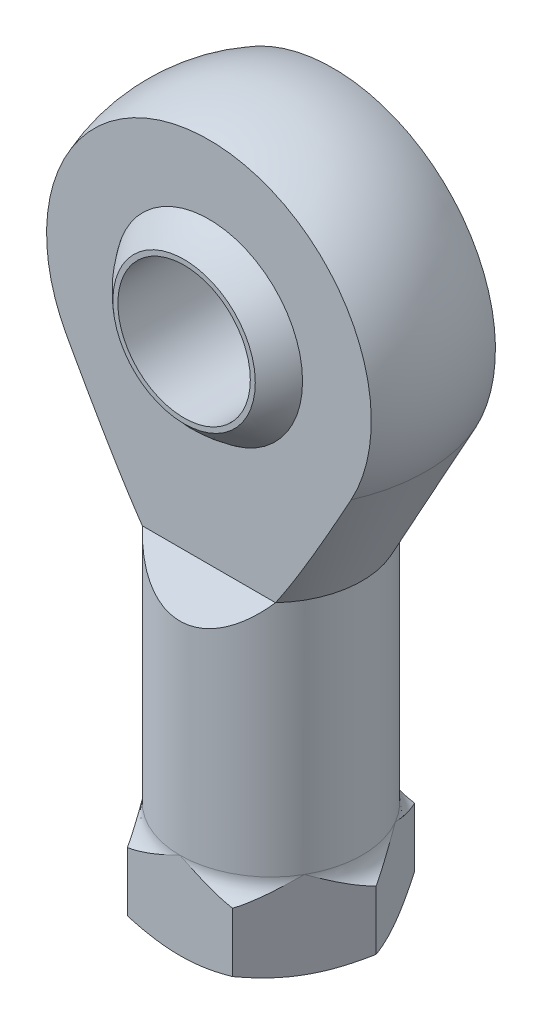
ISO-10303-21;
HEADER;
FILE_DESCRIPTION(('STEP AP214'),'2;1');
FILE_NAME('part.step','',(''),(''),'','','');
FILE_SCHEMA(('AUTOMOTIVE_DESIGN { 1 0 10303 214 1 1 1 1 }'));
ENDSEC;
DATA;
#1=APPLICATION_CONTEXT('core data for automotive mechanical design processes');
#2=APPLICATION_PROTOCOL_DEFINITION('international standard','automotive_design',2000,#1);
#3=PRODUCT_CONTEXT('',#1,'mechanical');
#4=PRODUCT('Part','Part','',(#3));
#5=PRODUCT_RELATED_PRODUCT_CATEGORY('part','',(#4));
#6=PRODUCT_DEFINITION_FORMATION('','',#4);
#7=PRODUCT_DEFINITION_CONTEXT('part definition',#1,'design');
#8=PRODUCT_DEFINITION('design','',#6,#7);
#9=PRODUCT_DEFINITION_SHAPE('','',#8);
#10=(LENGTH_UNIT() NAMED_UNIT(*) SI_UNIT(.MILLI.,.METRE.));
#11=(NAMED_UNIT(*) PLANE_ANGLE_UNIT() SI_UNIT($,.RADIAN.));
#12=(NAMED_UNIT(*) SI_UNIT($,.STERADIAN.) SOLID_ANGLE_UNIT());
#13=UNCERTAINTY_MEASURE_WITH_UNIT(LENGTH_MEASURE(1.E-05),#10,'distance_accuracy_value','');
#14=(GEOMETRIC_REPRESENTATION_CONTEXT(3) GLOBAL_UNCERTAINTY_ASSIGNED_CONTEXT((#13)) GLOBAL_UNIT_ASSIGNED_CONTEXT((#10,
#11,#12)) REPRESENTATION_CONTEXT('',''));
#15=CARTESIAN_POINT('',(0.,0.,0.));
#16=DIRECTION('',(0.,0.,1.));
#17=DIRECTION('',(1.,0.,0.));
#18=AXIS2_PLACEMENT_3D('',#15,#16,#17);
#19=CARTESIAN_POINT('',(0.,-29.,0.));
#20=DIRECTION('',(0.,-1.,0.));
#21=DIRECTION('',(0.,0.,-1.));
#22=AXIS2_PLACEMENT_3D('',#19,#20,#21);
#23=CONICAL_SURFACE('',#22,6.,1.0471975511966);
#24=CARTESIAN_POINT('',(0.,-26.6905989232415,0.));
#25=DIRECTION('',(0.,-1.,0.));
#26=DIRECTION('',(0.,0.,1.));
#27=AXIS2_PLACEMENT_3D('',#24,#25,#26);
#28=CIRCLE('',#27,2.);
#29=CARTESIAN_POINT('',(0.,-26.6905989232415,-2.));
#30=VERTEX_POINT('',#29);
#31=EDGE_CURVE('P0_E138',#30,#30,#28,.T.);
#32=CARTESIAN_POINT('',(0.,-29.,0.));
#33=DIRECTION('',(0.,-1.,0.));
#34=DIRECTION('',(0.,0.,1.));
#35=AXIS2_PLACEMENT_3D('',#32,#33,#34);
#36=CIRCLE('',#35,6.);
#37=CARTESIAN_POINT('',(0.,-29.,-6.));
#38=VERTEX_POINT('',#37);
#39=EDGE_CURVE('P0_E868',#38,#38,#36,.F.);
#40=CARTESIAN_POINT('',(0.,-26.6905989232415,-2.));
#41=CARTESIAN_POINT('',(0.,-26.7146551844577,-2.04166666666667));
#42=CARTESIAN_POINT('',(0.,-26.738711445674,-2.08333333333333));
#43=CARTESIAN_POINT('',(0.,-26.7868239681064,-2.16666666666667));
#44=CARTESIAN_POINT('',(0.,-26.8108802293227,-2.20833333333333));
#45=CARTESIAN_POINT('',(0.,-26.8589927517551,-2.29166666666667));
#46=CARTESIAN_POINT('',(0.,-26.8830490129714,-2.33333333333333));
#47=CARTESIAN_POINT('',(0.,-26.9311615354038,-2.41666666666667));
#48=CARTESIAN_POINT('',(0.,-26.9552177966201,-2.45833333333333));
#49=CARTESIAN_POINT('',(0.,-27.0033303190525,-2.54166666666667));
#50=CARTESIAN_POINT('',(0.,-27.0273865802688,-2.58333333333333));
#51=CARTESIAN_POINT('',(0.,-27.0754991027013,-2.66666666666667));
#52=CARTESIAN_POINT('',(0.,-27.0995553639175,-2.70833333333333));
#53=CARTESIAN_POINT('',(0.,-27.14766788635,-2.79166666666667));
#54=CARTESIAN_POINT('',(0.,-27.1717241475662,-2.83333333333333));
#55=CARTESIAN_POINT('',(0.,-27.2198366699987,-2.91666666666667));
#56=CARTESIAN_POINT('',(0.,-27.2438929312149,-2.95833333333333));
#57=CARTESIAN_POINT('',(0.,-27.2920054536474,-3.04166666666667));
#58=CARTESIAN_POINT('',(0.,-27.3160617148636,-3.08333333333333));
#59=CARTESIAN_POINT('',(0.,-27.3641742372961,-3.16666666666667));
#60=CARTESIAN_POINT('',(0.,-27.3882304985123,-3.20833333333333));
#61=CARTESIAN_POINT('',(0.,-27.4363430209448,-3.29166666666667));
#62=CARTESIAN_POINT('',(0.,-27.460399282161,-3.33333333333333));
#63=CARTESIAN_POINT('',(0.,-27.5085118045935,-3.41666666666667));
#64=CARTESIAN_POINT('',(0.,-27.5325680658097,-3.45833333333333));
#65=CARTESIAN_POINT('',(0.,-27.5806805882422,-3.54166666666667));
#66=CARTESIAN_POINT('',(0.,-27.6047368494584,-3.58333333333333));
#67=CARTESIAN_POINT('',(0.,-27.6528493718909,-3.66666666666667));
#68=CARTESIAN_POINT('',(0.,-27.6769056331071,-3.70833333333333));
#69=CARTESIAN_POINT('',(0.,-27.7250181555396,-3.79166666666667));
#70=CARTESIAN_POINT('',(0.,-27.7490744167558,-3.83333333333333));
#71=CARTESIAN_POINT('',(0.,-27.7971869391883,-3.91666666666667));
#72=CARTESIAN_POINT('',(0.,-27.8212432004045,-3.95833333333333));
#73=CARTESIAN_POINT('',(0.,-27.869355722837,-4.04166666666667));
#74=CARTESIAN_POINT('',(0.,-27.8934119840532,-4.08333333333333));
#75=CARTESIAN_POINT('',(0.,-27.9415245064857,-4.16666666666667));
#76=CARTESIAN_POINT('',(0.,-27.9655807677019,-4.20833333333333));
#77=CARTESIAN_POINT('',(0.,-28.0136932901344,-4.29166666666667));
#78=CARTESIAN_POINT('',(0.,-28.0377495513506,-4.33333333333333));
#79=CARTESIAN_POINT('',(0.,-28.0858620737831,-4.41666666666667));
#80=CARTESIAN_POINT('',(0.,-28.1099183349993,-4.45833333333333));
#81=CARTESIAN_POINT('',(0.,-28.1580308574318,-4.54166666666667));
#82=CARTESIAN_POINT('',(0.,-28.182087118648,-4.58333333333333));
#83=CARTESIAN_POINT('',(0.,-28.2301996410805,-4.66666666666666));
#84=CARTESIAN_POINT('',(0.,-28.2542559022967,-4.70833333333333));
#85=CARTESIAN_POINT('',(0.,-28.3023684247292,-4.79166666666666));
#86=CARTESIAN_POINT('',(0.,-28.3264246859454,-4.83333333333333));
#87=CARTESIAN_POINT('',(0.,-28.3745372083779,-4.91666666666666));
#88=CARTESIAN_POINT('',(0.,-28.3985934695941,-4.95833333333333));
#89=CARTESIAN_POINT('',(0.,-28.4467059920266,-5.04166666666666));
#90=CARTESIAN_POINT('',(0.,-28.4707622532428,-5.08333333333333));
#91=CARTESIAN_POINT('',(0.,-28.5188747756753,-5.16666666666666));
#92=CARTESIAN_POINT('',(0.,-28.5429310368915,-5.20833333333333));
#93=CARTESIAN_POINT('',(0.,-28.591043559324,-5.29166666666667));
#94=CARTESIAN_POINT('',(0.,-28.6150998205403,-5.33333333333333));
#95=CARTESIAN_POINT('',(0.,-28.6632123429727,-5.41666666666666));
#96=CARTESIAN_POINT('',(0.,-28.687268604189,-5.45833333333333));
#97=CARTESIAN_POINT('',(0.,-28.7353811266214,-5.54166666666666));
#98=CARTESIAN_POINT('',(0.,-28.7594373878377,-5.58333333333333));
#99=CARTESIAN_POINT('',(0.,-28.8075499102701,-5.66666666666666));
#100=CARTESIAN_POINT('',(0.,-28.8316061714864,-5.70833333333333));
#101=CARTESIAN_POINT('',(0.,-28.8797186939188,-5.79166666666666));
#102=CARTESIAN_POINT('',(0.,-28.9037749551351,-5.83333333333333));
#103=CARTESIAN_POINT('',(0.,-28.9518874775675,-5.91666666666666));
#104=CARTESIAN_POINT('',(0.,-28.9759437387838,-5.95833333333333));
#105=CARTESIAN_POINT('',(0.,-29.,-6.));
#106=B_SPLINE_CURVE_WITH_KNOTS('',3,(#40,#41,#42,#43,#44,#45,#46,#47,#48,#49,#50,#51,#52,#53,
#54,#55,#56,#57,#58,#59,#60,#61,#62,#63,#64,#65,#66,#67,#68,#69,#70,#71,#72,#73,#74,#75,#76,#77,
#78,#79,#80,#81,#82,#83,#84,#85,#86,#87,#88,#89,#90,#91,#92,#93,#94,#95,#96,#97,#98,#99,#100,
#101,#102,#103,#104,#105),.UNSPECIFIED.,.F.,.F.,(4,2,2,2,2,2,2,2,2,2,2,2,2,2,2,2,2,2,2,2,2,2,2,
2,2,2,2,2,2,2,2,2,4),(0.,0.144337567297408,0.288675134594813,0.433012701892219,
0.577350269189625,0.721687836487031,0.866025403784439,1.01036297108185,1.15470053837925,
1.29903810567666,1.44337567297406,1.58771324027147,1.73205080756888,1.87638837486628,
2.02072594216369,2.16506350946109,2.3094010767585,2.45373864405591,2.59807621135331,
2.74241377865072,2.88675134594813,3.03108891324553,3.17542648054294,3.31976404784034,
3.46410161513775,3.60843918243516,3.75277674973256,3.89711431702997,4.04145188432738,
4.18578945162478,4.33012701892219,4.47446458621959,4.618802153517),.UNSPECIFIED.);
#107=EDGE_CURVE('P0_BSEAM16',#30,#38,#106,.T.);
#108=ORIENTED_EDGE('',*,*,#31,.F.);
#109=ORIENTED_EDGE('',*,*,#39,.F.);
#110=ORIENTED_EDGE('',*,*,#107,.T.);
#111=ORIENTED_EDGE('',*,*,#107,.F.);
#112=EDGE_LOOP('',(#108,#110,#109,#111));
#113=FACE_BOUND('',#112,.T.);
#114=ADVANCED_FACE('P0_F16',(#113),#23,.F.);
#115=CARTESIAN_POINT('',(0.,-29.,0.));
#116=DIRECTION('',(0.,-1.,0.));
#117=DIRECTION('',(0.,0.,-1.));
#118=AXIS2_PLACEMENT_3D('',#115,#116,#117);
#119=CYLINDRICAL_SURFACE('',#118,6.);
#120=CARTESIAN_POINT('',(0.,-64.,0.));
#121=DIRECTION('',(0.,-1.,0.));
#122=DIRECTION('',(0.,0.,-1.));
#123=AXIS2_PLACEMENT_3D('',#120,#121,#122);
#124=CIRCLE('',#123,6.);
#125=CARTESIAN_POINT('',(0.,-64.,-6.));
#126=VERTEX_POINT('',#125);
#127=EDGE_CURVE('P0_E137',#126,#126,#124,.F.);
#128=ORIENTED_EDGE('',*,*,#127,.F.);
#129=EDGE_LOOP('',(#128));
#130=FACE_BOUND('',#129,.T.);
#131=ORIENTED_EDGE('',*,*,#39,.T.);
#132=EDGE_LOOP('',(#131));
#133=FACE_BOUND('',#132,.T.);
#134=ADVANCED_FACE('P0_F318',(#130,#133),#119,.F.);
#135=CARTESIAN_POINT('',(0.,-13.4249663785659,0.));
#136=DIRECTION('',(0.,-1.,0.));
#137=DIRECTION('',(1.,0.,0.));
#138=AXIS2_PLACEMENT_3D('',#135,#136,#137);
#139=CYLINDRICAL_SURFACE('',#138,2.);
#140=CARTESIAN_POINT('',(0.,-13.4249663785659,0.));
#141=DIRECTION('',(0.,-1.,0.));
#142=DIRECTION('',(1.,0.,0.));
#143=AXIS2_PLACEMENT_3D('',#140,#141,#142);
#144=CIRCLE('',#143,2.);
#145=CARTESIAN_POINT('',(2.,-13.4249663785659,0.));
#146=VERTEX_POINT('',#145);
#147=EDGE_CURVE('P0_E834',#146,#146,#144,.T.);
#148=ORIENTED_EDGE('',*,*,#147,.F.);
#149=EDGE_LOOP('',(#148));
#150=FACE_BOUND('',#149,.T.);
#151=ORIENTED_EDGE('',*,*,#31,.T.);
#152=EDGE_LOOP('',(#151));
#153=FACE_BOUND('',#152,.T.);
#154=ADVANCED_FACE('P0_F315',(#150,#153),#139,.F.);
#155=CARTESIAN_POINT('',(0.,-64.,0.));
#156=DIRECTION('',(0.,1.,0.));
#157=DIRECTION('',(0.,0.,1.));
#158=AXIS2_PLACEMENT_3D('',#155,#156,#157);
#159=CONICAL_SURFACE('',#158,11.,1.04719755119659);
#160=CARTESIAN_POINT('',(0.,-64.,0.));
#161=DIRECTION('',(0.,1.,0.));
#162=DIRECTION('',(0.,0.,1.));
#163=AXIS2_PLACEMENT_3D('',#160,#161,#162);
#164=CIRCLE('',#163,11.);
#165=CARTESIAN_POINT('',(9.52627944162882,-64.,-5.5));
#166=VERTEX_POINT('',#165);
#167=CARTESIAN_POINT('',(9.52627944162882,-64.,5.5));
#168=VERTEX_POINT('',#167);
#169=EDGE_CURVE('P0_E19',#166,#168,#164,.F.);
#170=ORIENTED_EDGE('',*,*,#169,.F.);
#171=CARTESIAN_POINT('',(12.7017059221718,-63.0175196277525,0.));
#172=CARTESIAN_POINT('',(12.4431088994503,-63.166804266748,-0.447903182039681));
#173=CARTESIAN_POINT('',(12.1826138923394,-63.3035576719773,-0.899093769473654));
#174=CARTESIAN_POINT('',(11.7898134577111,-63.4845812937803,-1.57944407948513));
#175=CARTESIAN_POINT('',(11.6588618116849,-63.5407957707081,-1.80625898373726));
#176=CARTESIAN_POINT('',(11.3961000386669,-63.6445383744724,-2.2613757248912));
#177=CARTESIAN_POINT('',(11.2642899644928,-63.6920670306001,-2.48967747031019));
#178=CARTESIAN_POINT('',(10.9997389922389,-63.7776806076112,-2.94789319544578));
#179=CARTESIAN_POINT('',(10.8669971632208,-63.8157540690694,-3.17780878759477));
#180=CARTESIAN_POINT('',(10.6008786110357,-63.8816573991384,-3.63873964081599));
#181=CARTESIAN_POINT('',(10.4675019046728,-63.9094875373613,-3.86975487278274));
#182=CARTESIAN_POINT('',(10.1996195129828,-63.9544193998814,-4.33374078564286));
#183=CARTESIAN_POINT('',(10.0651115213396,-63.9714665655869,-4.566715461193));
#184=CARTESIAN_POINT('',(9.79583100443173,-63.9942806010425,-5.03312299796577));
#185=CARTESIAN_POINT('',(9.66105843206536,-64.0000452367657,-5.26655594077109));
#186=CARTESIAN_POINT('',(9.52627944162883,-64.,-5.5));
#187=B_SPLINE_CURVE_WITH_KNOTS('',3,(#171,#172,#173,#174,#175,#176,#177,#178,#179,#180,#181,
#182,#183,#184,#185,#186),.UNSPECIFIED.,.F.,.F.,(4,2,2,2,2,2,2,4),(0.,1.61488064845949,
2.4183753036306,3.22182097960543,4.02623570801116,4.83062926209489,5.63906091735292,
6.44765263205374),.UNSPECIFIED.);
#188=CARTESIAN_POINT('',(12.7017059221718,-63.0175196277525,0.));
#189=VERTEX_POINT('',#188);
#190=EDGE_CURVE('P0_E153',#189,#166,#187,.T.);
#191=ORIENTED_EDGE('',*,*,#190,.F.);
#192=CARTESIAN_POINT('',(9.52627944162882,-64.,5.5));
#193=CARTESIAN_POINT('',(9.66105843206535,-64.0000452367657,5.26655594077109));
#194=CARTESIAN_POINT('',(9.79583100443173,-63.9942806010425,5.03312299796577));
#195=CARTESIAN_POINT('',(10.0651115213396,-63.9714665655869,4.566715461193));
#196=CARTESIAN_POINT('',(10.1996195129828,-63.9544193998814,4.33374078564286));
#197=CARTESIAN_POINT('',(10.4675019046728,-63.9094875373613,3.86975487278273));
#198=CARTESIAN_POINT('',(10.6008786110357,-63.8816573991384,3.63873964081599));
#199=CARTESIAN_POINT('',(10.8669971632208,-63.8157540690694,3.17780878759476));
#200=CARTESIAN_POINT('',(10.9997389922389,-63.7776806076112,2.94789319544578));
#201=CARTESIAN_POINT('',(11.2642899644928,-63.6920670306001,2.48967747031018));
#202=CARTESIAN_POINT('',(11.3961000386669,-63.6445383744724,2.26137572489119));
#203=CARTESIAN_POINT('',(11.6588618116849,-63.5407957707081,1.80625898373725));
#204=CARTESIAN_POINT('',(11.7898134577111,-63.4845812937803,1.57944407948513));
#205=CARTESIAN_POINT('',(12.1826138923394,-63.3035576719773,0.899093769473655));
#206=CARTESIAN_POINT('',(12.4431088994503,-63.166804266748,0.447903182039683));
#207=CARTESIAN_POINT('',(12.7017059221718,-63.0175196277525,0.));
#208=B_SPLINE_CURVE_WITH_KNOTS('',3,(#192,#193,#194,#195,#196,#197,#198,#199,#200,#201,#202,
#203,#204,#205,#206,#207),.UNSPECIFIED.,.F.,.F.,(4,2,2,2,2,2,2,4),(0.,0.808591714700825,
1.61702336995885,2.42141692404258,3.22583165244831,4.02927732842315,4.83277198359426,
6.44765263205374),.UNSPECIFIED.);
#209=EDGE_CURVE('P0_E150',#168,#189,#208,.T.);
#210=ORIENTED_EDGE('',*,*,#209,.F.);
#211=EDGE_LOOP('',(#170,#191,#210));
#212=FACE_BOUND('',#211,.T.);
#213=ADVANCED_FACE('P0_F151',(#212),#159,.T.);
#214=CARTESIAN_POINT('',(11.1320033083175,-64.,-11.));
#215=DIRECTION('',(0.,-1.,0.));
#216=DIRECTION('',(0.,0.,1.));
#217=AXIS2_PLACEMENT_3D('',#214,#215,#216);
#218=PLANE('',#217);
#219=ORIENTED_EDGE('',*,*,#127,.T.);
#220=EDGE_LOOP('',(#219));
#221=FACE_BOUND('',#220,.T.);
#222=ORIENTED_EDGE('',*,*,#169,.T.);
#223=CARTESIAN_POINT('',(0.,-64.,0.));
#224=DIRECTION('',(0.,1.,0.));
#225=DIRECTION('',(0.,0.,1.));
#226=AXIS2_PLACEMENT_3D('',#223,#224,#225);
#227=CIRCLE('',#226,11.);
#228=CARTESIAN_POINT('',(0.,-64.,11.));
#229=VERTEX_POINT('',#228);
#230=EDGE_CURVE('P0_E132',#229,#168,#227,.T.);
#231=ORIENTED_EDGE('',*,*,#230,.F.);
#232=CARTESIAN_POINT('',(0.,-64.,0.));
#233=DIRECTION('',(0.,1.,0.));
#234=DIRECTION('',(0.,0.,1.));
#235=AXIS2_PLACEMENT_3D('',#232,#233,#234);
#236=CIRCLE('',#235,11.);
#237=CARTESIAN_POINT('',(-9.52627944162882,-64.,5.5));
#238=VERTEX_POINT('',#237);
#239=EDGE_CURVE('P0_E522',#238,#229,#236,.T.);
#240=ORIENTED_EDGE('',*,*,#239,.F.);
#241=CARTESIAN_POINT('',(0.,-64.,0.));
#242=DIRECTION('',(0.,1.,0.));
#243=DIRECTION('',(0.,0.,1.));
#244=AXIS2_PLACEMENT_3D('',#241,#242,#243);
#245=CIRCLE('',#244,11.);
#246=CARTESIAN_POINT('',(-9.52627944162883,-64.,-5.5));
#247=VERTEX_POINT('',#246);
#248=EDGE_CURVE('P0_E523',#247,#238,#245,.T.);
#249=ORIENTED_EDGE('',*,*,#248,.F.);
#250=CARTESIAN_POINT('',(0.,-64.,0.));
#251=DIRECTION('',(0.,1.,0.));
#252=DIRECTION('',(0.,0.,1.));
#253=AXIS2_PLACEMENT_3D('',#250,#251,#252);
#254=CIRCLE('',#253,11.);
#255=CARTESIAN_POINT('',(0.,-64.,-11.));
#256=VERTEX_POINT('',#255);
#257=EDGE_CURVE('P0_E147',#256,#247,#254,.T.);
#258=ORIENTED_EDGE('',*,*,#257,.F.);
#259=CARTESIAN_POINT('',(0.,-64.,0.));
#260=DIRECTION('',(0.,1.,0.));
#261=DIRECTION('',(0.,0.,1.));
#262=AXIS2_PLACEMENT_3D('',#259,#260,#261);
#263=CIRCLE('',#262,11.);
#264=EDGE_CURVE('P0_E135',#166,#256,#263,.T.);
#265=ORIENTED_EDGE('',*,*,#264,.F.);
#266=EDGE_LOOP('',(#222,#231,#240,#249,#258,#265));
#267=FACE_BOUND('',#266,.T.);
#268=ADVANCED_FACE('P0_F131',(#221,#267),#218,.T.);
#269=CARTESIAN_POINT('',(0.,0.,0.));
#270=DIRECTION('',(0.,0.,1.));
#271=DIRECTION('',(-1.,0.,0.));
#272=AXIS2_PLACEMENT_3D('',#269,#270,#271);
#273=SPHERICAL_SURFACE('',#272,13.573125);
#274=CARTESIAN_POINT('',(0.,0.,-7.5));
#275=DIRECTION('',(0.,0.,1.));
#276=DIRECTION('',(1.,0.,0.));
#277=AXIS2_PLACEMENT_3D('',#274,#275,#276);
#278=CIRCLE('',#277,11.3128123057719);
#279=CARTESIAN_POINT('',(11.3128123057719,0.,-7.5));
#280=VERTEX_POINT('',#279);
#281=EDGE_CURVE('P0_E535',#280,#280,#278,.T.);
#282=ORIENTED_EDGE('',*,*,#281,.F.);
#283=EDGE_LOOP('',(#282));
#284=FACE_BOUND('',#283,.T.);
#285=CARTESIAN_POINT('',(0.,0.,7.5));
#286=DIRECTION('',(0.,0.,1.));
#287=DIRECTION('',(1.,0.,0.));
#288=AXIS2_PLACEMENT_3D('',#285,#286,#287);
#289=CIRCLE('',#288,11.3128123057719);
#290=CARTESIAN_POINT('',(11.3128123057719,0.,7.5));
#291=VERTEX_POINT('',#290);
#292=EDGE_CURVE('P0_E524',#291,#291,#289,.F.);
#293=ORIENTED_EDGE('',*,*,#292,.F.);
#294=EDGE_LOOP('',(#293));
#295=FACE_BOUND('',#294,.T.);
#296=ORIENTED_EDGE('',*,*,#147,.T.);
#297=EDGE_LOOP('',(#296));
#298=FACE_BOUND('',#297,.T.);
#299=ADVANCED_FACE('P0_F294',(#284,#295,#298),#273,.F.);
#300=CARTESIAN_POINT('',(0.,-64.,0.));
#301=DIRECTION('',(0.,1.,0.));
#302=DIRECTION('',(0.,0.,1.));
#303=AXIS2_PLACEMENT_3D('',#300,#301,#302);
#304=CONICAL_SURFACE('',#303,11.,1.04719755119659);
#305=ORIENTED_EDGE('',*,*,#264,.T.);
#306=CARTESIAN_POINT('',(6.35085296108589,-63.0175196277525,-11.));
#307=CARTESIAN_POINT('',(5.83365891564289,-63.166804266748,-11.));
#308=CARTESIAN_POINT('',(5.31266890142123,-63.3035576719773,-11.));
#309=CARTESIAN_POINT('',(4.52706803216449,-63.4845812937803,-11.));
#310=CARTESIAN_POINT('',(4.26516474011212,-63.5407957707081,-11.));
#311=CARTESIAN_POINT('',(3.73964119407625,-63.6445383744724,-11.));
#312=CARTESIAN_POINT('',(3.47602104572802,-63.6920670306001,-11.));
#313=CARTESIAN_POINT('',(2.94691910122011,-63.7776806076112,-11.));
#314=CARTESIAN_POINT('',(2.68143544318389,-63.8157540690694,-11.));
#315=CARTESIAN_POINT('',(2.14919833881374,-63.8816573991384,-11.));
#316=CARTESIAN_POINT('',(1.88244492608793,-63.9094875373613,-11.));
#317=CARTESIAN_POINT('',(1.34668014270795,-63.9544193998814,-11.));
#318=CARTESIAN_POINT('',(1.07766415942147,-63.9714665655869,-11.));
#319=CARTESIAN_POINT('',(0.539103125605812,-63.9942806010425,-11.));
#320=CARTESIAN_POINT('',(0.269557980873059,-64.0000452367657,-11.));
#321=CARTESIAN_POINT('',(0.,-64.,-11.));
#322=B_SPLINE_CURVE_WITH_KNOTS('',3,(#306,#307,#308,#309,#310,#311,#312,#313,#314,#315,#316,
#317,#318,#319,#320,#321),.UNSPECIFIED.,.F.,.F.,(4,2,2,2,2,2,2,4),(0.,1.61488064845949,
2.4183753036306,3.22182097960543,4.02623570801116,4.8306292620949,5.63906091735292,
6.44765263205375),.UNSPECIFIED.);
#323=CARTESIAN_POINT('',(6.35085296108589,-63.0175196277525,-11.));
#324=VERTEX_POINT('',#323);
#325=EDGE_CURVE('P0_E272',#324,#256,#322,.T.);
#326=ORIENTED_EDGE('',*,*,#325,.F.);
#327=CARTESIAN_POINT('',(9.52627944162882,-64.,-5.50000000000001));
#328=CARTESIAN_POINT('',(9.39150045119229,-64.0000452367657,-5.73344405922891));
#329=CARTESIAN_POINT('',(9.25672787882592,-63.9942806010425,-5.96687700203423));
#330=CARTESIAN_POINT('',(8.98744736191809,-63.9714665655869,-6.433284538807));
#331=CARTESIAN_POINT('',(8.85293937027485,-63.9544193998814,-6.66625921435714));
#332=CARTESIAN_POINT('',(8.58505697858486,-63.9094875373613,-7.13024512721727));
#333=CARTESIAN_POINT('',(8.45168027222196,-63.8816573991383,-7.36126035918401));
#334=CARTESIAN_POINT('',(8.18556172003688,-63.8157540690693,-7.82219121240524));
#335=CARTESIAN_POINT('',(8.05281989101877,-63.7776806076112,-8.05210680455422));
#336=CARTESIAN_POINT('',(7.78826891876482,-63.6920670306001,-8.51032252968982));
#337=CARTESIAN_POINT('',(7.6564588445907,-63.6445383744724,-8.73862427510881));
#338=CARTESIAN_POINT('',(7.39369707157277,-63.5407957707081,-9.19374101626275));
#339=CARTESIAN_POINT('',(7.26274542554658,-63.4845812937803,-9.42055592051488));
#340=CARTESIAN_POINT('',(6.86994499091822,-63.3035576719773,-10.1009062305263));
#341=CARTESIAN_POINT('',(6.60944998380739,-63.166804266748,-10.5520968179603));
#342=CARTESIAN_POINT('',(6.35085296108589,-63.0175196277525,-11.));
#343=B_SPLINE_CURVE_WITH_KNOTS('',3,(#327,#328,#329,#330,#331,#332,#333,#334,#335,#336,#337,
#338,#339,#340,#341,#342),.UNSPECIFIED.,.F.,.F.,(4,2,2,2,2,2,2,4),(0.,0.808591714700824,
1.61702336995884,2.42141692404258,3.22583165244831,4.02927732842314,4.83277198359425,
6.44765263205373),.UNSPECIFIED.);
#344=EDGE_CURVE('P0_E301',#166,#324,#343,.T.);
#345=ORIENTED_EDGE('',*,*,#344,.F.);
#346=EDGE_LOOP('',(#305,#326,#345));
#347=FACE_BOUND('',#346,.T.);
#348=ADVANCED_FACE('P0_F289',(#347),#304,.T.);
#349=CARTESIAN_POINT('',(12.7017059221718,-64.063,0.));
#350=DIRECTION('',(0.866025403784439,0.,-0.5));
#351=DIRECTION('',(-0.5,0.,-0.866025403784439));
#352=AXIS2_PLACEMENT_3D('',#349,#350,#351);
#353=PLANE('',#352);
#354=CARTESIAN_POINT('',(12.7017059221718,-55.8691193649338,0.));
#355=CARTESIAN_POINT('',(12.6353507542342,-55.8467528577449,-0.114941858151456));
#356=CARTESIAN_POINT('',(12.5692157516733,-55.8218971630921,-0.229507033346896));
#357=CARTESIAN_POINT('',(12.4353335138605,-55.76680405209,-0.461420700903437));
#358=CARTESIAN_POINT('',(12.367600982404,-55.7364219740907,-0.578743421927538));
#359=CARTESIAN_POINT('',(12.230634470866,-55.6703619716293,-0.815958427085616));
#360=CARTESIAN_POINT('',(12.1614159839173,-55.6345530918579,-0.935822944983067));
#361=CARTESIAN_POINT('',(12.0215817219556,-55.5577596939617,-1.17797144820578));
#362=CARTESIAN_POINT('',(11.9509822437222,-55.5166568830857,-1.30022720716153));
#363=CARTESIAN_POINT('',(11.8156241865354,-55.4338261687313,-1.53468963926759));
#364=CARTESIAN_POINT('',(11.7508214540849,-55.3923717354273,-1.64696790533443));
#365=CARTESIAN_POINT('',(11.6191342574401,-55.3048142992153,-1.87511528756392));
#366=CARTESIAN_POINT('',(11.5522693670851,-55.2585920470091,-1.99094985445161));
#367=CARTESIAN_POINT('',(11.4165141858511,-55.161522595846,-2.22609224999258));
#368=CARTESIAN_POINT('',(11.3476428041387,-55.1105666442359,-2.34536598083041));
#369=CARTESIAN_POINT('',(11.2079202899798,-55.004108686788,-2.5873312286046));
#370=CARTESIAN_POINT('',(11.137087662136,-54.948508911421,-2.70999030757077));
#371=CARTESIAN_POINT('',(11.0055535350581,-54.8426504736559,-2.93782285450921));
#372=CARTESIAN_POINT('',(10.944787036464,-54.7926966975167,-3.04310094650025));
#373=CARTESIAN_POINT('',(10.8198257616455,-54.688061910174,-3.25957911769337));
#374=CARTESIAN_POINT('',(10.7556517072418,-54.6332797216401,-3.37074221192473));
#375=CARTESIAN_POINT('',(10.6239066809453,-54.5189646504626,-3.59892612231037));
#376=CARTESIAN_POINT('',(10.5563548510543,-54.4593406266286,-3.71591224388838));
#377=CARTESIAN_POINT('',(10.4178595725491,-54.3353873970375,-3.95575550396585));
#378=CARTESIAN_POINT('',(10.3469336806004,-54.270979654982,-4.07858209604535));
#379=CARTESIAN_POINT('',(10.2284655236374,-54.1623108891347,-4.2838087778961));
#380=CARTESIAN_POINT('',(10.1808476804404,-54.1183363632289,-4.36631745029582));
#381=CARTESIAN_POINT('',(10.075656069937,-54.020604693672,-4.54855565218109));
#382=CARTESIAN_POINT('',(10.0181037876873,-53.9667431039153,-4.6482416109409));
#383=CARTESIAN_POINT('',(9.89310978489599,-53.8490854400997,-4.86471538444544));
#384=CARTESIAN_POINT('',(9.82568919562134,-53.7851909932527,-4.98146180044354));
#385=CARTESIAN_POINT('',(9.68092836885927,-53.6475475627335,-5.23214238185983));
#386=CARTESIAN_POINT('',(9.60360175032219,-53.5737441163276,-5.3660545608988));
#387=CARTESIAN_POINT('',(9.52627944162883,-53.5,-5.5));
#388=B_SPLINE_CURVE_WITH_KNOTS('',3,(#354,#355,#356,#357,#358,#359,#360,#361,#362,#363,#364,
#365,#366,#367,#368,#369,#370,#371,#372,#373,#374,#375,#376,#377,#378,#379,#380,#381,#382,#383,
#384,#385,#386,#387),.UNSPECIFIED.,.F.,.F.,(4,2,2,2,2,2,2,2,2,2,2,2,2,2,2,2,4),(0.,
0.403727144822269,0.820150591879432,1.24899775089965,1.69004966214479,2.09832367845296,
2.52281731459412,2.96334700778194,3.4198121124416,3.81406267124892,4.23272683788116,
4.67570263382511,5.14301480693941,5.45778387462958,5.83903716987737,6.2866074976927,
6.80063807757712),.UNSPECIFIED.);
#389=CARTESIAN_POINT('',(12.7017059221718,-55.8691193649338,0.));
#390=VERTEX_POINT('',#389);
#391=CARTESIAN_POINT('',(9.52627944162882,-53.5,-5.5));
#392=VERTEX_POINT('',#391);
#393=EDGE_CURVE('P0_E843',#390,#392,#388,.T.);
#394=ORIENTED_EDGE('',*,*,#393,.F.);
#395=DIRECTION('',(0.,1.,0.));
#396=VECTOR('',#395,1.);
#397=CARTESIAN_POINT('',(12.7017059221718,-64.,0.));
#398=LINE('',#397,#396);
#399=EDGE_CURVE('P0_E156',#189,#390,#398,.T.);
#400=ORIENTED_EDGE('',*,*,#399,.F.);
#401=ORIENTED_EDGE('',*,*,#190,.T.);
#402=ORIENTED_EDGE('',*,*,#344,.T.);
#403=DIRECTION('',(0.,1.,0.));
#404=VECTOR('',#403,1.);
#405=CARTESIAN_POINT('',(6.35085296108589,-64.,-11.));
#406=LINE('',#405,#404);
#407=CARTESIAN_POINT('',(6.35085296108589,-55.8691193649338,-11.));
#408=VERTEX_POINT('',#407);
#409=EDGE_CURVE('P0_E226',#408,#324,#406,.F.);
#410=ORIENTED_EDGE('',*,*,#409,.F.);
#411=CARTESIAN_POINT('',(9.52627944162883,-53.5,-5.5));
#412=CARTESIAN_POINT('',(9.44894391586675,-53.5737408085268,-5.63392979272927));
#413=CARTESIAN_POINT('',(9.37163934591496,-53.6475409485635,-5.76784668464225));
#414=CARTESIAN_POINT('',(9.22692866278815,-53.7851800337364,-6.0185454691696));
#415=CARTESIAN_POINT('',(9.15953477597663,-53.8490734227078,-6.13530458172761));
#416=CARTESIAN_POINT('',(9.03456005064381,-53.9667312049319,-6.35178937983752));
#417=CARTESIAN_POINT('',(8.97700449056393,-54.0205939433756,-6.45147607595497));
#418=CARTESIAN_POINT('',(8.87177273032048,-54.1183299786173,-6.63370183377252));
#419=CARTESIAN_POINT('',(8.824123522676,-54.1623077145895,-6.71620050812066));
#420=CARTESIAN_POINT('',(8.70562738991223,-54.2709751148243,-6.92140793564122));
#421=CARTESIAN_POINT('',(8.63472423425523,-54.3353783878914,-7.04423638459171));
#422=CARTESIAN_POINT('',(8.49626813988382,-54.4593259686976,-7.28408698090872));
#423=CARTESIAN_POINT('',(8.42873285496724,-54.5189487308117,-7.40107868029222));
#424=CARTESIAN_POINT('',(8.29699256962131,-54.6332642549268,-7.62926494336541));
#425=CARTESIAN_POINT('',(8.23280802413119,-54.6880480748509,-7.74042561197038));
#426=CARTESIAN_POINT('',(8.10780647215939,-54.7926886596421,-7.95689574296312));
#427=CARTESIAN_POINT('',(8.0470111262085,-54.8426465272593,-8.06216879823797));
#428=CARTESIAN_POINT('',(7.91546927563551,-54.9485046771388,-8.28999683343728));
#429=CARTESIAN_POINT('',(7.84466472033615,-55.0041003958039,-8.41266029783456));
#430=CARTESIAN_POINT('',(7.70498493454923,-55.1105535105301,-8.65463404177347));
#431=CARTESIAN_POINT('',(7.6361285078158,-55.161508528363,-8.7739121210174));
#432=CARTESIAN_POINT('',(7.500367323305,-55.2585787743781,-9.00905047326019));
#433=CARTESIAN_POINT('',(7.43348261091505,-55.3048026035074,-9.12487736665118));
#434=CARTESIAN_POINT('',(7.30173783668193,-55.3923651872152,-9.35300755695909));
#435=CARTESIAN_POINT('',(7.23689789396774,-55.4338230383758,-9.46527667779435));
#436=CARTESIAN_POINT('',(7.10152293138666,-55.5166553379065,-9.69973662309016));
#437=CARTESIAN_POINT('',(7.03094803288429,-55.5577567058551,-9.82200136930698));
#438=CARTESIAN_POINT('',(6.89116126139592,-55.6345485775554,-10.0641701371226));
#439=CARTESIAN_POINT('',(6.82196566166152,-55.6703572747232,-10.1840459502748));
#440=CARTESIAN_POINT('',(6.685015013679,-55.7364178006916,-10.421269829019));
#441=CARTESIAN_POINT('',(6.61727624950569,-55.766800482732,-10.5385906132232));
#442=CARTESIAN_POINT('',(6.48337141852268,-55.8218953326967,-10.7704983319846));
#443=CARTESIAN_POINT('',(6.41722030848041,-55.8467520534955,-10.8850596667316));
#444=CARTESIAN_POINT('',(6.35085296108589,-55.8691193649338,-11.));
#445=B_SPLINE_CURVE_WITH_KNOTS('',3,(#411,#412,#413,#414,#415,#416,#417,#418,#419,#420,#421,
#422,#423,#424,#425,#426,#427,#428,#429,#430,#431,#432,#433,#434,#435,#436,#437,#438,#439,#440,
#441,#442,#443,#444),.UNSPECIFIED.,.F.,.F.,(4,2,2,2,2,2,2,2,2,2,2,2,2,2,2,2,4),(0.,
0.514007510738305,0.96157009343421,1.34283103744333,1.65762327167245,2.12490324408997,
2.56786806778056,2.98654283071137,3.38082596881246,3.83725804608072,4.27777633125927,
4.70228076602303,5.110588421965,5.55162615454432,5.98046835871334,6.39689641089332,
6.80063805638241),.UNSPECIFIED.);
#446=EDGE_CURVE('P0_E545',#392,#408,#445,.T.);
#447=ORIENTED_EDGE('',*,*,#446,.F.);
#448=EDGE_LOOP('',(#394,#400,#401,#402,#410,#447));
#449=FACE_BOUND('',#448,.T.);
#450=ADVANCED_FACE('P0_F293',(#449),#353,.T.);
#451=CARTESIAN_POINT('',(0.,-64.,0.));
#452=DIRECTION('',(0.,1.,0.));
#453=DIRECTION('',(0.,0.,1.));
#454=AXIS2_PLACEMENT_3D('',#451,#452,#453);
#455=CONICAL_SURFACE('',#454,11.,1.04719755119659);
#456=CARTESIAN_POINT('',(0.,-64.,-11.));
#457=CARTESIAN_POINT('',(-0.269557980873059,-64.0000452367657,-11.));
#458=CARTESIAN_POINT('',(-0.539103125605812,-63.9942806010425,-11.));
#459=CARTESIAN_POINT('',(-1.07766415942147,-63.9714665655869,-11.));
#460=CARTESIAN_POINT('',(-1.34668014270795,-63.9544193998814,-11.));
#461=CARTESIAN_POINT('',(-1.88244492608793,-63.9094875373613,-11.));
#462=CARTESIAN_POINT('',(-2.14919833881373,-63.8816573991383,-11.));
#463=CARTESIAN_POINT('',(-2.68143544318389,-63.8157540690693,-11.));
#464=CARTESIAN_POINT('',(-2.9469191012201,-63.7776806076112,-11.));
#465=CARTESIAN_POINT('',(-3.47602104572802,-63.6920670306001,-11.));
#466=CARTESIAN_POINT('',(-3.73964119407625,-63.6445383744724,-11.));
#467=CARTESIAN_POINT('',(-4.26516474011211,-63.5407957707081,-11.));
#468=CARTESIAN_POINT('',(-4.52706803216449,-63.4845812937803,-11.));
#469=CARTESIAN_POINT('',(-5.31266890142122,-63.3035576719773,-11.));
#470=CARTESIAN_POINT('',(-5.83365891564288,-63.166804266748,-11.));
#471=CARTESIAN_POINT('',(-6.35085296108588,-63.0175196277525,-11.));
#472=B_SPLINE_CURVE_WITH_KNOTS('',3,(#456,#457,#458,#459,#460,#461,#462,#463,#464,#465,#466,
#467,#468,#469,#470,#471),.UNSPECIFIED.,.F.,.F.,(4,2,2,2,2,2,2,4),(0.,0.808591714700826,
1.61702336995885,2.42141692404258,3.22583165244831,4.02927732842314,4.83277198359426,
6.44765263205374),.UNSPECIFIED.);
#473=CARTESIAN_POINT('',(-6.35085296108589,-63.0175196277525,-11.));
#474=VERTEX_POINT('',#473);
#475=EDGE_CURVE('P0_E268',#256,#474,#472,.T.);
#476=ORIENTED_EDGE('',*,*,#475,.F.);
#477=ORIENTED_EDGE('',*,*,#257,.T.);
#478=CARTESIAN_POINT('',(-6.35085296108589,-63.0175196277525,-11.));
#479=CARTESIAN_POINT('',(-6.60944998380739,-63.166804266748,-10.5520968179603));
#480=CARTESIAN_POINT('',(-6.86994499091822,-63.3035576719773,-10.1009062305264));
#481=CARTESIAN_POINT('',(-7.26274542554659,-63.4845812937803,-9.42055592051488));
#482=CARTESIAN_POINT('',(-7.39369707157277,-63.5407957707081,-9.19374101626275));
#483=CARTESIAN_POINT('',(-7.6564588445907,-63.6445383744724,-8.73862427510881));
#484=CARTESIAN_POINT('',(-7.78826891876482,-63.6920670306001,-8.51032252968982));
#485=CARTESIAN_POINT('',(-8.05281989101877,-63.7776806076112,-8.05210680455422));
#486=CARTESIAN_POINT('',(-8.18556172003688,-63.8157540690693,-7.82219121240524));
#487=CARTESIAN_POINT('',(-8.45168027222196,-63.8816573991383,-7.36126035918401));
#488=CARTESIAN_POINT('',(-8.58505697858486,-63.9094875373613,-7.13024512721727));
#489=CARTESIAN_POINT('',(-8.85293937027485,-63.9544193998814,-6.66625921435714));
#490=CARTESIAN_POINT('',(-8.98744736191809,-63.9714665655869,-6.433284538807));
#491=CARTESIAN_POINT('',(-9.25672787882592,-63.9942806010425,-5.96687700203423));
#492=CARTESIAN_POINT('',(-9.39150045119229,-64.0000452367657,-5.73344405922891));
#493=CARTESIAN_POINT('',(-9.52627944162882,-64.,-5.50000000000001));
#494=B_SPLINE_CURVE_WITH_KNOTS('',3,(#478,#479,#480,#481,#482,#483,#484,#485,#486,#487,#488,
#489,#490,#491,#492,#493),.UNSPECIFIED.,.F.,.F.,(4,2,2,2,2,2,2,4),(0.,1.61488064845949,
2.4183753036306,3.22182097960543,4.02623570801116,4.8306292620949,5.63906091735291,
6.44765263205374),.UNSPECIFIED.);
#495=EDGE_CURVE('P0_E189',#474,#247,#494,.T.);
#496=ORIENTED_EDGE('',*,*,#495,.F.);
#497=EDGE_LOOP('',(#476,#477,#496));
#498=FACE_BOUND('',#497,.T.);
#499=ADVANCED_FACE('P0_F178',(#498),#455,.T.);
#500=CARTESIAN_POINT('',(0.,-64.,0.));
#501=DIRECTION('',(0.,1.,0.));
#502=DIRECTION('',(0.,0.,1.));
#503=AXIS2_PLACEMENT_3D('',#500,#501,#502);
#504=CONICAL_SURFACE('',#503,11.,1.0471975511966);
#505=ORIENTED_EDGE('',*,*,#230,.T.);
#506=CARTESIAN_POINT('',(6.35085296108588,-63.0175196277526,11.));
#507=CARTESIAN_POINT('',(6.60944998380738,-63.166804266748,10.5520968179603));
#508=CARTESIAN_POINT('',(6.86994499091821,-63.3035576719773,10.1009062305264));
#509=CARTESIAN_POINT('',(7.26274542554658,-63.4845812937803,9.42055592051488));
#510=CARTESIAN_POINT('',(7.39369707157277,-63.5407957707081,9.19374101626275));
#511=CARTESIAN_POINT('',(7.6564588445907,-63.6445383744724,8.73862427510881));
#512=CARTESIAN_POINT('',(7.78826891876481,-63.6920670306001,8.51032252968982));
#513=CARTESIAN_POINT('',(8.05281989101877,-63.7776806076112,8.05210680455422));
#514=CARTESIAN_POINT('',(8.18556172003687,-63.8157540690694,7.82219121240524));
#515=CARTESIAN_POINT('',(8.45168027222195,-63.8816573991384,7.36126035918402));
#516=CARTESIAN_POINT('',(8.58505697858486,-63.9094875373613,7.13024512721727));
#517=CARTESIAN_POINT('',(8.85293937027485,-63.9544193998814,6.66625921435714));
#518=CARTESIAN_POINT('',(8.98744736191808,-63.9714665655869,6.433284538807));
#519=CARTESIAN_POINT('',(9.25672787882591,-63.9942806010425,5.96687700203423));
#520=CARTESIAN_POINT('',(9.39150045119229,-64.0000452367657,5.73344405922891));
#521=CARTESIAN_POINT('',(9.52627944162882,-64.,5.5));
#522=B_SPLINE_CURVE_WITH_KNOTS('',3,(#506,#507,#508,#509,#510,#511,#512,#513,#514,#515,#516,
#517,#518,#519,#520,#521),.UNSPECIFIED.,.F.,.F.,(4,2,2,2,2,2,2,4),(0.,1.61488064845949,
2.4183753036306,3.22182097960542,4.02623570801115,4.83062926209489,5.63906091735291,
6.44765263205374),.UNSPECIFIED.);
#523=CARTESIAN_POINT('',(6.35085296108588,-63.0175196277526,11.));
#524=VERTEX_POINT('',#523);
#525=EDGE_CURVE('P0_E142',#524,#168,#522,.T.);
#526=ORIENTED_EDGE('',*,*,#525,.F.);
#527=CARTESIAN_POINT('',(0.,-64.,11.));
#528=CARTESIAN_POINT('',(0.269557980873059,-64.0000452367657,11.));
#529=CARTESIAN_POINT('',(0.539103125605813,-63.9942806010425,11.));
#530=CARTESIAN_POINT('',(1.07766415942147,-63.9714665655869,11.));
#531=CARTESIAN_POINT('',(1.34668014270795,-63.9544193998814,11.));
#532=CARTESIAN_POINT('',(1.88244492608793,-63.9094875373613,11.));
#533=CARTESIAN_POINT('',(2.14919833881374,-63.8816573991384,11.));
#534=CARTESIAN_POINT('',(2.68143544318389,-63.8157540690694,11.));
#535=CARTESIAN_POINT('',(2.9469191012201,-63.7776806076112,11.));
#536=CARTESIAN_POINT('',(3.47602104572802,-63.6920670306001,11.));
#537=CARTESIAN_POINT('',(3.73964119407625,-63.6445383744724,11.));
#538=CARTESIAN_POINT('',(4.26516474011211,-63.5407957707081,11.));
#539=CARTESIAN_POINT('',(4.52706803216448,-63.4845812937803,11.));
#540=CARTESIAN_POINT('',(5.31266890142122,-63.3035576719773,11.));
#541=CARTESIAN_POINT('',(5.83365891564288,-63.166804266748,11.));
#542=CARTESIAN_POINT('',(6.35085296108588,-63.0175196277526,11.));
#543=B_SPLINE_CURVE_WITH_KNOTS('',3,(#527,#528,#529,#530,#531,#532,#533,#534,#535,#536,#537,
#538,#539,#540,#541,#542),.UNSPECIFIED.,.F.,.F.,(4,2,2,2,2,2,2,4),(0.,0.808591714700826,
1.61702336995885,2.42141692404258,3.22583165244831,4.02927732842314,4.83277198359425,
6.44765263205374),.UNSPECIFIED.);
#544=EDGE_CURVE('P0_E145',#229,#524,#543,.T.);
#545=ORIENTED_EDGE('',*,*,#544,.F.);
#546=EDGE_LOOP('',(#505,#526,#545));
#547=FACE_BOUND('',#546,.T.);
#548=ADVANCED_FACE('P0_F140',(#547),#504,.T.);
#549=CARTESIAN_POINT('',(6.35085296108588,-64.063,11.));
#550=DIRECTION('',(0.866025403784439,0.,0.5));
#551=DIRECTION('',(0.5,0.,-0.866025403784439));
#552=AXIS2_PLACEMENT_3D('',#549,#550,#551);
#553=PLANE('',#552);
#554=CARTESIAN_POINT('',(6.35085296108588,-55.8691193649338,11.));
#555=CARTESIAN_POINT('',(6.4172179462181,-55.8467528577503,10.8850638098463));
#556=CARTESIAN_POINT('',(6.48336679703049,-55.8218971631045,10.7705066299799));
#557=CARTESIAN_POINT('',(6.61726880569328,-55.7668040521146,10.5386043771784));
#558=CARTESIAN_POINT('',(6.68500699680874,-55.7364219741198,10.4212849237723));
#559=CARTESIAN_POINT('',(6.821957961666,-55.6703619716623,10.1840609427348));
#560=CARTESIAN_POINT('',(6.89115443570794,-55.6345530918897,10.0641837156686));
#561=CARTESIAN_POINT('',(7.03094406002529,-55.5577596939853,9.82200944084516));
#562=CARTESIAN_POINT('',(7.10152091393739,-55.5166568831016,9.69974061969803));
#563=CARTESIAN_POINT('',(7.23689230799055,-55.4338261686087,9.46528588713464));
#564=CARTESIAN_POINT('',(7.30172677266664,-55.3923717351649,9.35302594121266));
#565=CARTESIAN_POINT('',(7.43346460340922,-55.3048142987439,9.12490779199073));
#566=CARTESIAN_POINT('',(7.50034783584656,-55.2585920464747,9.00908381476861));
#567=CARTESIAN_POINT('',(7.63610953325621,-55.1615225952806,8.7739451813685));
#568=CARTESIAN_POINT('',(7.70496792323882,-55.1105666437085,8.65466394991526));
#569=CARTESIAN_POINT('',(7.84465471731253,-55.0041086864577,8.4126780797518));
#570=CARTESIAN_POINT('',(7.91546428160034,-54.9485089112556,8.29000568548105));
#571=CARTESIAN_POINT('',(8.04700599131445,-54.8426504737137,8.06217751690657));
#572=CARTESIAN_POINT('',(8.10779624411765,-54.7926966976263,7.95691313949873));
#573=CARTESIAN_POINT('',(8.23279120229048,-54.6880619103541,7.74045441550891));
#574=CARTESIAN_POINT('',(8.29697423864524,-54.6332797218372,7.62929650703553));
#575=CARTESIAN_POINT('',(8.42871478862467,-54.5189646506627,7.40111001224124));
#576=CARTESIAN_POINT('',(8.49625182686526,-54.4593406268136,7.2841153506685));
#577=CARTESIAN_POINT('',(8.63471454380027,-54.3353873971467,7.0442532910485));
#578=CARTESIAN_POINT('',(8.70562254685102,-54.2709796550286,6.92141637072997));
#579=CARTESIAN_POINT('',(8.82411998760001,-54.1623108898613,6.71620659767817));
#580=CARTESIAN_POINT('',(8.87176567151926,-54.1183363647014,6.63371400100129));
#581=CARTESIAN_POINT('',(8.97699277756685,-54.0206046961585,6.4514962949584));
#582=CARTESIAN_POINT('',(9.03454720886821,-53.9667431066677,6.35181157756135));
#583=CARTESIAN_POINT('',(9.15952199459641,-53.84908544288,6.13532670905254));
#584=CARTESIAN_POINT('',(9.22691706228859,-53.7851909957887,6.01856555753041));
#585=CARTESIAN_POINT('',(9.37163240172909,-53.6475475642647,5.76785871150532));
#586=CARTESIAN_POINT('',(9.44894044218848,-53.5737441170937,5.63393580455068));
#587=CARTESIAN_POINT('',(9.52627944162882,-53.5,5.5));
#588=B_SPLINE_CURVE_WITH_KNOTS('',3,(#554,#555,#556,#557,#558,#559,#560,#561,#562,#563,#564,
#565,#566,#567,#568,#569,#570,#571,#572,#573,#574,#575,#576,#577,#578,#579,#580,#581,#582,#583,
#584,#585,#586,#587),.UNSPECIFIED.,.F.,.F.,(4,2,2,2,2,2,2,2,2,2,2,2,2,2,2,2,4),(0.,
0.403727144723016,0.820150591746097,1.24899775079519,1.69004966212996,2.09832367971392,
2.52281731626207,2.96334700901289,3.41981211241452,3.81406267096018,4.23272683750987,
4.67570263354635,5.14301480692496,5.4577838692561,5.83903716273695,6.28660749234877,
6.80063807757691),.UNSPECIFIED.);
#589=CARTESIAN_POINT('',(6.35085296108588,-55.8691193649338,11.));
#590=VERTEX_POINT('',#589);
#591=CARTESIAN_POINT('',(9.52627944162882,-53.5,5.5));
#592=VERTEX_POINT('',#591);
#593=EDGE_CURVE('P0_E538',#590,#592,#588,.T.);
#594=ORIENTED_EDGE('',*,*,#593,.F.);
#595=DIRECTION('',(0.,1.,0.));
#596=VECTOR('',#595,1.);
#597=CARTESIAN_POINT('',(6.35085296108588,-64.,11.));
#598=LINE('',#597,#596);
#599=EDGE_CURVE('P0_E160',#524,#590,#598,.T.);
#600=ORIENTED_EDGE('',*,*,#599,.F.);
#601=ORIENTED_EDGE('',*,*,#525,.T.);
#602=ORIENTED_EDGE('',*,*,#209,.T.);
#603=ORIENTED_EDGE('',*,*,#399,.T.);
#604=CARTESIAN_POINT('',(9.52627944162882,-53.5,5.5));
#605=CARTESIAN_POINT('',(9.60359828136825,-53.5737408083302,5.36606057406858));
#606=CARTESIAN_POINT('',(9.68092142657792,-53.6475409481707,5.23215440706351));
#607=CARTESIAN_POINT('',(9.82567760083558,-53.7851800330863,4.98148188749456));
#608=CARTESIAN_POINT('',(9.89309701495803,-53.8490734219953,4.86473751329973));
#609=CARTESIAN_POINT('',(10.0180909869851,-53.9667312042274,4.64826382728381));
#610=CARTESIAN_POINT('',(10.0756444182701,-54.0205939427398,4.54857590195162));
#611=CARTESIAN_POINT('',(10.1808406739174,-54.118329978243,4.36632964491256));
#612=CARTESIAN_POINT('',(10.2284620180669,-54.1623077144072,4.28381488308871));
#613=CARTESIAN_POINT('',(10.3469287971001,-54.2709751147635,4.07859050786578));
#614=CARTESIAN_POINT('',(10.4178497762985,-54.3353783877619,3.95577234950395));
#615=CARTESIAN_POINT('',(10.5563384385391,-54.4593259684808,3.71594055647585));
#616=CARTESIAN_POINT('',(10.6238885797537,-54.5189487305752,3.59895743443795));
#617=CARTESIAN_POINT('',(10.7556335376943,-54.6332642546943,3.37077386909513));
#618=CARTESIAN_POINT('',(10.8198092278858,-54.6880480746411,3.25960808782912));
#619=CARTESIAN_POINT('',(10.9447770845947,-54.7926886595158,3.04311850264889));
#620=CARTESIAN_POINT('',(11.0055485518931,-54.8426465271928,2.93783166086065));
#621=CARTESIAN_POINT('',(11.137082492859,-54.9485046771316,2.70999905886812));
#622=CARTESIAN_POINT('',(11.2079098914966,-55.0041003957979,2.58734878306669));
#623=CARTESIAN_POINT('',(11.3476254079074,-55.1105535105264,2.34539566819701));
#624=CARTESIAN_POINT('',(11.4164950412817,-55.1615085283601,2.22612521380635));
#625=CARTESIAN_POINT('',(11.5522502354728,-55.2585787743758,1.99098340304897));
#626=CARTESIAN_POINT('',(11.6191169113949,-55.3048026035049,1.87514609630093));
#627=CARTESIAN_POINT('',(11.7508110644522,-55.3923651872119,1.646986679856));
#628=CARTESIAN_POINT('',(11.815619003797,-55.433823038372,1.53469908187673));
#629=CARTESIAN_POINT('',(11.9509797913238,-55.516655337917,1.30023095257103));
#630=CARTESIAN_POINT('',(12.0215767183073,-55.5577567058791,1.1779789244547));
#631=CARTESIAN_POINT('',(12.1614076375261,-55.6345485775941,0.935835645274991));
#632=CARTESIAN_POINT('',(12.2306253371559,-55.670357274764,0.815972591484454));
#633=CARTESIAN_POINT('',(12.3675919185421,-55.7364178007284,0.578757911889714));
#634=CARTESIAN_POINT('',(12.4353253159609,-55.7668004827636,0.461434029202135));
#635=CARTESIAN_POINT('',(12.5692108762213,-55.821895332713,0.229515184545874));
#636=CARTESIAN_POINT('',(12.6353483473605,-55.8467520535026,0.114945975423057));
#637=CARTESIAN_POINT('',(12.7017059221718,-55.8691193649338,0.));
#638=B_SPLINE_CURVE_WITH_KNOTS('',3,(#604,#605,#606,#607,#608,#609,#610,#611,#612,#613,#614,
#615,#616,#617,#618,#619,#620,#621,#622,#623,#624,#625,#626,#627,#628,#629,#630,#631,#632,#633,
#634,#635,#636,#637),.UNSPECIFIED.,.F.,.F.,(4,2,2,2,2,2,2,2,2,2,2,2,2,2,2,2,4),(0.,
0.514007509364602,0.961570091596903,1.34283103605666,1.65762327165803,2.1249032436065,
2.5678680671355,2.98654283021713,3.38082596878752,3.83725804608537,4.27777633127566,
4.70228076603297,5.1105884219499,5.55162615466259,5.98046835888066,6.3968964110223,
6.80063805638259),.UNSPECIFIED.);
#639=EDGE_CURVE('P0_E618',#592,#390,#638,.T.);
#640=ORIENTED_EDGE('',*,*,#639,.F.);
#641=EDGE_LOOP('',(#594,#600,#601,#602,#603,#640));
#642=FACE_BOUND('',#641,.T.);
#643=ADVANCED_FACE('P0_F158',(#642),#553,.T.);
#644=CARTESIAN_POINT('',(0.,-64.,0.));
#645=DIRECTION('',(0.,1.,0.));
#646=DIRECTION('',(0.,0.,1.));
#647=AXIS2_PLACEMENT_3D('',#644,#645,#646);
#648=CONICAL_SURFACE('',#647,11.,1.04719755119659);
#649=CARTESIAN_POINT('',(-9.52627944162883,-64.,5.5));
#650=CARTESIAN_POINT('',(-9.3915004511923,-64.0000452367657,5.73344405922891));
#651=CARTESIAN_POINT('',(-9.25672787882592,-63.9942806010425,5.96687700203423));
#652=CARTESIAN_POINT('',(-8.98744736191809,-63.9714665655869,6.433284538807));
#653=CARTESIAN_POINT('',(-8.85293937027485,-63.9544193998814,6.66625921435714));
#654=CARTESIAN_POINT('',(-8.58505697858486,-63.9094875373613,7.13024512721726));
#655=CARTESIAN_POINT('',(-8.45168027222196,-63.8816573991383,7.36126035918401));
#656=CARTESIAN_POINT('',(-8.18556172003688,-63.8157540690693,7.82219121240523));
#657=CARTESIAN_POINT('',(-8.05281989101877,-63.7776806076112,8.05210680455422));
#658=CARTESIAN_POINT('',(-7.78826891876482,-63.6920670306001,8.51032252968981));
#659=CARTESIAN_POINT('',(-7.65645884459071,-63.6445383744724,8.7386242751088));
#660=CARTESIAN_POINT('',(-7.39369707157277,-63.5407957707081,9.19374101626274));
#661=CARTESIAN_POINT('',(-7.26274542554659,-63.4845812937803,9.42055592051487));
#662=CARTESIAN_POINT('',(-6.86994499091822,-63.3035576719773,10.1009062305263));
#663=CARTESIAN_POINT('',(-6.60944998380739,-63.166804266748,10.5520968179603));
#664=CARTESIAN_POINT('',(-6.35085296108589,-63.0175196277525,11.));
#665=B_SPLINE_CURVE_WITH_KNOTS('',3,(#649,#650,#651,#652,#653,#654,#655,#656,#657,#658,#659,
#660,#661,#662,#663,#664),.UNSPECIFIED.,.F.,.F.,(4,2,2,2,2,2,2,4),(0.,0.808591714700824,
1.61702336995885,2.42141692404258,3.22583165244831,4.02927732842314,4.83277198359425,
6.44765263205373),.UNSPECIFIED.);
#666=CARTESIAN_POINT('',(-6.35085296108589,-63.0175196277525,11.));
#667=VERTEX_POINT('',#666);
#668=EDGE_CURVE('P0_E463',#238,#667,#665,.T.);
#669=ORIENTED_EDGE('',*,*,#668,.F.);
#670=ORIENTED_EDGE('',*,*,#239,.T.);
#671=CARTESIAN_POINT('',(-6.35085296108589,-63.0175196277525,11.));
#672=CARTESIAN_POINT('',(-5.83365891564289,-63.166804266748,11.));
#673=CARTESIAN_POINT('',(-5.31266890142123,-63.3035576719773,11.));
#674=CARTESIAN_POINT('',(-4.52706803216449,-63.4845812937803,11.));
#675=CARTESIAN_POINT('',(-4.26516474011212,-63.5407957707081,11.));
#676=CARTESIAN_POINT('',(-3.73964119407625,-63.6445383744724,11.));
#677=CARTESIAN_POINT('',(-3.47602104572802,-63.6920670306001,11.));
#678=CARTESIAN_POINT('',(-2.94691910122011,-63.7776806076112,11.));
#679=CARTESIAN_POINT('',(-2.6814354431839,-63.8157540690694,11.));
#680=CARTESIAN_POINT('',(-2.14919833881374,-63.8816573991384,11.));
#681=CARTESIAN_POINT('',(-1.88244492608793,-63.9094875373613,11.));
#682=CARTESIAN_POINT('',(-1.34668014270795,-63.9544193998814,11.));
#683=CARTESIAN_POINT('',(-1.07766415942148,-63.9714665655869,11.));
#684=CARTESIAN_POINT('',(-0.539103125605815,-63.9942806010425,11.));
#685=CARTESIAN_POINT('',(-0.269557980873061,-64.0000452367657,11.));
#686=CARTESIAN_POINT('',(0.,-64.,11.));
#687=B_SPLINE_CURVE_WITH_KNOTS('',3,(#671,#672,#673,#674,#675,#676,#677,#678,#679,#680,#681,
#682,#683,#684,#685,#686),.UNSPECIFIED.,.F.,.F.,(4,2,2,2,2,2,2,4),(0.,1.61488064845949,
2.4183753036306,3.22182097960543,4.02623570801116,4.8306292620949,5.63906091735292,
6.44765263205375),.UNSPECIFIED.);
#688=EDGE_CURVE('P0_E190',#667,#229,#687,.T.);
#689=ORIENTED_EDGE('',*,*,#688,.F.);
#690=EDGE_LOOP('',(#669,#670,#689));
#691=FACE_BOUND('',#690,.T.);
#692=ADVANCED_FACE('P0_F493',(#691),#648,.T.);
#693=CARTESIAN_POINT('',(0.,-64.,0.));
#694=DIRECTION('',(0.,1.,0.));
#695=DIRECTION('',(0.,0.,1.));
#696=AXIS2_PLACEMENT_3D('',#693,#694,#695);
#697=CONICAL_SURFACE('',#696,11.,1.04719755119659);
#698=CARTESIAN_POINT('',(-9.52627944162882,-64.,-5.50000000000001));
#699=CARTESIAN_POINT('',(-9.66105843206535,-64.0000452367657,-5.2665559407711));
#700=CARTESIAN_POINT('',(-9.79583100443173,-63.9942806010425,-5.03312299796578));
#701=CARTESIAN_POINT('',(-10.0651115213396,-63.9714665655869,-4.56671546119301));
#702=CARTESIAN_POINT('',(-10.1996195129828,-63.9544193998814,-4.33374078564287));
#703=CARTESIAN_POINT('',(-10.4675019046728,-63.9094875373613,-3.86975487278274));
#704=CARTESIAN_POINT('',(-10.6008786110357,-63.8816573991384,-3.63873964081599));
#705=CARTESIAN_POINT('',(-10.8669971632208,-63.8157540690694,-3.17780878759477));
#706=CARTESIAN_POINT('',(-10.9997389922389,-63.7776806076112,-2.94789319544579));
#707=CARTESIAN_POINT('',(-11.2642899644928,-63.6920670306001,-2.48967747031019));
#708=CARTESIAN_POINT('',(-11.3961000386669,-63.6445383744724,-2.2613757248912));
#709=CARTESIAN_POINT('',(-11.6588618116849,-63.5407957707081,-1.80625898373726));
#710=CARTESIAN_POINT('',(-11.7898134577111,-63.4845812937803,-1.57944407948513));
#711=CARTESIAN_POINT('',(-12.1826138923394,-63.3035576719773,-0.899093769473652));
#712=CARTESIAN_POINT('',(-12.4431088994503,-63.166804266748,-0.447903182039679));
#713=CARTESIAN_POINT('',(-12.7017059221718,-63.0175196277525,0.));
#714=B_SPLINE_CURVE_WITH_KNOTS('',3,(#698,#699,#700,#701,#702,#703,#704,#705,#706,#707,#708,
#709,#710,#711,#712,#713),.UNSPECIFIED.,.F.,.F.,(4,2,2,2,2,2,2,4),(0.,0.808591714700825,
1.61702336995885,2.42141692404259,3.22583165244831,4.02927732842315,4.83277198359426,
6.44765263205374),.UNSPECIFIED.);
#715=CARTESIAN_POINT('',(-12.7017059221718,-63.0175196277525,0.));
#716=VERTEX_POINT('',#715);
#717=EDGE_CURVE('P0_E234',#247,#716,#714,.T.);
#718=ORIENTED_EDGE('',*,*,#717,.F.);
#719=ORIENTED_EDGE('',*,*,#248,.T.);
#720=CARTESIAN_POINT('',(-12.7017059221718,-63.0175196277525,0.));
#721=CARTESIAN_POINT('',(-12.4431088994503,-63.166804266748,0.447903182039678));
#722=CARTESIAN_POINT('',(-12.1826138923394,-63.3035576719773,0.899093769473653));
#723=CARTESIAN_POINT('',(-11.7898134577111,-63.4845812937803,1.57944407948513));
#724=CARTESIAN_POINT('',(-11.6588618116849,-63.5407957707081,1.80625898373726));
#725=CARTESIAN_POINT('',(-11.3961000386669,-63.6445383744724,2.2613757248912));
#726=CARTESIAN_POINT('',(-11.2642899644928,-63.6920670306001,2.48967747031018));
#727=CARTESIAN_POINT('',(-10.9997389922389,-63.7776806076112,2.94789319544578));
#728=CARTESIAN_POINT('',(-10.8669971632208,-63.8157540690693,3.17780878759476));
#729=CARTESIAN_POINT('',(-10.6008786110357,-63.8816573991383,3.63873964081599));
#730=CARTESIAN_POINT('',(-10.4675019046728,-63.9094875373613,3.86975487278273));
#731=CARTESIAN_POINT('',(-10.1996195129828,-63.9544193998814,4.33374078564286));
#732=CARTESIAN_POINT('',(-10.0651115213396,-63.9714665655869,4.566715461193));
#733=CARTESIAN_POINT('',(-9.79583100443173,-63.9942806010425,5.03312299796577));
#734=CARTESIAN_POINT('',(-9.66105843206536,-64.0000452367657,5.26655594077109));
#735=CARTESIAN_POINT('',(-9.52627944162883,-64.,5.5));
#736=B_SPLINE_CURVE_WITH_KNOTS('',3,(#720,#721,#722,#723,#724,#725,#726,#727,#728,#729,#730,
#731,#732,#733,#734,#735),.UNSPECIFIED.,.F.,.F.,(4,2,2,2,2,2,2,4),(0.,1.61488064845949,
2.4183753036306,3.22182097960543,4.02623570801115,4.83062926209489,5.63906091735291,
6.44765263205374),.UNSPECIFIED.);
#737=EDGE_CURVE('P0_E455',#716,#238,#736,.T.);
#738=ORIENTED_EDGE('',*,*,#737,.F.);
#739=EDGE_LOOP('',(#718,#719,#738));
#740=FACE_BOUND('',#739,.T.);
#741=ADVANCED_FACE('P0_F496',(#740),#697,.T.);
#742=CARTESIAN_POINT('',(19.615045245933,-24.8,7.5));
#743=CARTESIAN_POINT('',(19.615045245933,19.615045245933,7.5));
#744=CARTESIAN_POINT('',(19.615045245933,20.0591956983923,7.5));
#745=B_SPLINE_CURVE_WITH_KNOTS('',1,(#742,#743,#744),.UNSPECIFIED.,.F.,.F.,(2,1,2),(0.,1.,1.01),.UNSPECIFIED.);
#746=DIRECTION('',(-1.,0.,0.));
#747=VECTOR('',#746,1.);
#748=SURFACE_OF_LINEAR_EXTRUSION('',#745,#747);
#749=ORIENTED_EDGE('',*,*,#292,.T.);
#750=EDGE_LOOP('',(#749));
#751=FACE_BOUND('',#750,.T.);
#752=CARTESIAN_POINT('',(17.1785663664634,-9.46820244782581,7.5));
#753=CARTESIAN_POINT('',(16.8912262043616,-9.98950834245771,7.5));
#754=CARTESIAN_POINT('',(16.6030226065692,-10.5103401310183,7.5));
#755=CARTESIAN_POINT('',(16.0246253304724,-11.5507423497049,7.5));
#756=CARTESIAN_POINT('',(15.734432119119,-12.0703130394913,7.5));
#757=CARTESIAN_POINT('',(15.1517240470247,-13.1080067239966,7.5));
#758=CARTESIAN_POINT('',(14.8592096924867,-13.6261300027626,7.5));
#759=CARTESIAN_POINT('',(14.2714252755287,-14.6606837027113,7.5));
#760=CARTESIAN_POINT('',(13.9761557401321,-15.1771144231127,7.5));
#761=CARTESIAN_POINT('',(13.382316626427,-16.2079760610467,7.5));
#762=CARTESIAN_POINT('',(13.0837475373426,-16.7224072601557,7.5));
#763=CARTESIAN_POINT('',(12.4825048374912,-17.7490487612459,7.5));
#764=CARTESIAN_POINT('',(12.1798301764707,-18.2612584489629,7.5));
#765=CARTESIAN_POINT('',(11.5695613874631,-19.2827406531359,7.5));
#766=CARTESIAN_POINT('',(11.2619672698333,-19.7920131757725,7.5));
#767=CARTESIAN_POINT('',(10.6406522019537,-20.8068759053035,7.5));
#768=CARTESIAN_POINT('',(10.3269307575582,-21.3124658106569,7.5));
#769=CARTESIAN_POINT('',(9.85050600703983,-22.0672595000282,7.5));
#770=CARTESIAN_POINT('',(9.69070125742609,-22.3182936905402,7.5));
#771=CARTESIAN_POINT('',(9.3688887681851,-22.8189435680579,7.5));
#772=CARTESIAN_POINT('',(9.20688105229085,-23.0685592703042,7.5));
#773=CARTESIAN_POINT('',(8.88025048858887,-23.5663078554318,7.5));
#774=CARTESIAN_POINT('',(8.71562601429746,-23.8144396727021,7.5));
#775=CARTESIAN_POINT('',(8.38346411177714,-24.3087581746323,7.5));
#776=CARTESIAN_POINT('',(8.21592657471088,-24.5549447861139,7.5));
#777=CARTESIAN_POINT('',(8.04673846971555,-24.8,7.5));
#778=B_SPLINE_CURVE_WITH_KNOTS('',3,(#752,#753,#754,#755,#756,#757,#758,#759,#760,#761,#762,
#763,#764,#765,#766,#767,#768,#769,#770,#771,#772,#773,#774,#775,#776,#777),.UNSPECIFIED.,.F.,
.F.,(4,2,2,2,2,2,2,2,2,2,2,2,4),(0.,1.78575568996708,3.57110571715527,5.35607654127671,
7.14071265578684,8.92508762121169,10.7099279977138,12.494764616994,14.2797457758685,
15.1724858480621,16.065216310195,16.9585252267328,17.8518675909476),.UNSPECIFIED.);
#779=CARTESIAN_POINT('',(17.1785663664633,-9.4682024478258,7.5));
#780=VERTEX_POINT('',#779);
#781=CARTESIAN_POINT('',(8.04673846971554,-24.8,7.5));
#782=VERTEX_POINT('',#781);
#783=EDGE_CURVE('P0_E283',#780,#782,#778,.T.);
#784=ORIENTED_EDGE('',*,*,#783,.F.);
#785=CARTESIAN_POINT('',(0.,0.,7.5));
#786=DIRECTION('',(0.,0.,1.));
#787=DIRECTION('',(1.,0.,0.));
#788=AXIS2_PLACEMENT_3D('',#785,#786,#787);
#789=CIRCLE('',#788,19.615045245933);
#790=CARTESIAN_POINT('',(-17.1785663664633,-9.4682024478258,7.5));
#791=VERTEX_POINT('',#790);
#792=EDGE_CURVE('P0_E530',#791,#780,#789,.F.);
#793=ORIENTED_EDGE('',*,*,#792,.F.);
#794=CARTESIAN_POINT('',(-8.04673846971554,-24.8,7.5));
#795=CARTESIAN_POINT('',(-8.22677979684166,-24.5392177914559,7.5));
#796=CARTESIAN_POINT('',(-8.40495585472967,-24.2771580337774,7.5));
#797=CARTESIAN_POINT('',(-8.75803747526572,-23.750859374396,7.5));
#798=CARTESIAN_POINT('',(-8.93294317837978,-23.486620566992,7.5));
#799=CARTESIAN_POINT('',(-9.27986860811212,-22.9564562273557,7.5));
#800=CARTESIAN_POINT('',(-9.45188979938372,-22.6905316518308,7.5));
#801=CARTESIAN_POINT('',(-9.79349840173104,-22.1571207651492,7.5));
#802=CARTESIAN_POINT('',(-9.96308578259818,-21.8896344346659,7.5));
#803=CARTESIAN_POINT('',(-10.4686061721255,-21.0852695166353,7.5));
#804=CARTESIAN_POINT('',(-10.8013584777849,-20.5463911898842,7.5));
#805=CARTESIAN_POINT('',(-11.4602424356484,-19.4646229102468,7.5));
#806=CARTESIAN_POINT('',(-11.7863741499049,-18.9217329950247,7.5));
#807=CARTESIAN_POINT('',(-12.4331709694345,-17.8331228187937,7.5));
#808=CARTESIAN_POINT('',(-12.7538390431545,-17.287404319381,7.5));
#809=CARTESIAN_POINT('',(-13.3909157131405,-16.1934286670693,7.5));
#810=CARTESIAN_POINT('',(-13.7073239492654,-15.6451713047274,7.5));
#811=CARTESIAN_POINT('',(-14.3366206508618,-14.5466094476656,7.5));
#812=CARTESIAN_POINT('',(-14.6495089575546,-13.9963048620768,7.5));
#813=CARTESIAN_POINT('',(-15.2723300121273,-12.8940403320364,7.5));
#814=CARTESIAN_POINT('',(-15.5822628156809,-12.3420804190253,7.5));
#815=CARTESIAN_POINT('',(-15.998813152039,-11.5963126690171,7.5));
#816=CARTESIAN_POINT('',(-16.1065246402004,-11.4031149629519,7.5));
#817=CARTESIAN_POINT('',(-16.3216574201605,-11.0165627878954,7.5));
#818=CARTESIAN_POINT('',(-16.4290787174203,-10.8232083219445,7.5));
#819=CARTESIAN_POINT('',(-16.6436594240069,-10.436329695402,7.5));
#820=CARTESIAN_POINT('',(-16.7508188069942,-10.2428055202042,7.5));
#821=CARTESIAN_POINT('',(-16.9648815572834,-9.85561077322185,7.5));
#822=CARTESIAN_POINT('',(-17.0717849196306,-9.66194019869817,7.5));
#823=CARTESIAN_POINT('',(-17.1785663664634,-9.4682024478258,7.5));
#824=B_SPLINE_CURVE_WITH_KNOTS('',3,(#794,#795,#796,#797,#798,#799,#800,#801,#802,#803,#804,
#805,#806,#807,#808,#809,#810,#811,#812,#813,#814,#815,#816,#817,#818,#819,#820,#821,#822,#823),
.UNSPECIFIED.,.F.,.F.,(4,2,2,2,2,2,2,2,2,2,2,2,2,2,4),(0.,0.950663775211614,1.901286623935,
2.85141119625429,3.80154755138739,5.70148451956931,7.6014036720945,9.50025536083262,
11.399266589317,13.298363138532,15.1974238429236,15.861007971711,16.5245795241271,
17.1882152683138,17.8518637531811),.UNSPECIFIED.);
#825=CARTESIAN_POINT('',(-8.04673846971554,-24.8,7.5));
#826=VERTEX_POINT('',#825);
#827=EDGE_CURVE('P0_E454',#826,#791,#824,.T.);
#828=ORIENTED_EDGE('',*,*,#827,.F.);
#829=DIRECTION('',(-1.,0.,0.));
#830=VECTOR('',#829,1.);
#831=CARTESIAN_POINT('',(8.04673846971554,-24.8,7.5));
#832=LINE('',#831,#830);
#833=EDGE_CURVE('P0_E451',#782,#826,#832,.T.);
#834=ORIENTED_EDGE('',*,*,#833,.F.);
#835=EDGE_LOOP('',(#784,#793,#828,#834));
#836=FACE_BOUND('',#835,.T.);
#837=ADVANCED_FACE('P0_F500',(#751,#836),#748,.T.);
#838=CARTESIAN_POINT('',(0.,0.,0.));
#839=DIRECTION('',(0.,0.,1.));
#840=DIRECTION('',(1.,0.,0.));
#841=AXIS2_PLACEMENT_3D('',#838,#839,#840);
#842=SPHERICAL_SURFACE('',#841,21.);
#843=CARTESIAN_POINT('',(0.,-9.4682024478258,0.));
#844=DIRECTION('',(0.,1.,0.));
#845=DIRECTION('',(0.,0.,1.));
#846=AXIS2_PLACEMENT_3D('',#843,#844,#845);
#847=CIRCLE('',#846,18.7444162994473);
#848=CARTESIAN_POINT('',(-17.1785663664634,-9.46820244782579,-7.5));
#849=VERTEX_POINT('',#848);
#850=EDGE_CURVE('P0_E684',#791,#849,#847,.F.);
#851=ORIENTED_EDGE('',*,*,#850,.F.);
#852=ORIENTED_EDGE('',*,*,#792,.T.);
#853=CARTESIAN_POINT('',(0.,-9.4682024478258,0.));
#854=DIRECTION('',(0.,1.,0.));
#855=DIRECTION('',(0.,0.,1.));
#856=AXIS2_PLACEMENT_3D('',#853,#854,#855);
#857=CIRCLE('',#856,18.7444162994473);
#858=CARTESIAN_POINT('',(17.1785663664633,-9.4682024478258,-7.5));
#859=VERTEX_POINT('',#858);
#860=EDGE_CURVE('P0_E544',#859,#780,#857,.F.);
#861=ORIENTED_EDGE('',*,*,#860,.F.);
#862=CARTESIAN_POINT('',(0.,0.,-7.5));
#863=DIRECTION('',(0.,0.,1.));
#864=DIRECTION('',(1.,0.,0.));
#865=AXIS2_PLACEMENT_3D('',#862,#863,#864);
#866=CIRCLE('',#865,19.615045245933);
#867=EDGE_CURVE('P0_E532',#849,#859,#866,.F.);
#868=ORIENTED_EDGE('',*,*,#867,.F.);
#869=EDGE_LOOP('',(#851,#852,#861,#868));
#870=FACE_BOUND('',#869,.T.);
#871=ADVANCED_FACE('P0_F507',(#870),#842,.T.);
#872=CARTESIAN_POINT('',(19.615045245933,20.0591956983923,-7.5));
#873=CARTESIAN_POINT('',(19.615045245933,19.615045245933,-7.5));
#874=CARTESIAN_POINT('',(19.615045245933,-24.8,-7.5));
#875=B_SPLINE_CURVE_WITH_KNOTS('',1,(#872,#873,#874),.UNSPECIFIED.,.F.,.F.,(2,1,2),(-0.01,0.,
1.),.UNSPECIFIED.);
#876=DIRECTION('',(-1.,0.,0.));
#877=VECTOR('',#876,1.);
#878=SURFACE_OF_LINEAR_EXTRUSION('',#875,#877);
#879=ORIENTED_EDGE('',*,*,#281,.T.);
#880=EDGE_LOOP('',(#879));
#881=FACE_BOUND('',#880,.T.);
#882=CARTESIAN_POINT('',(-17.1785663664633,-9.46820244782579,-7.5));
#883=CARTESIAN_POINT('',(-16.8912262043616,-9.98950834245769,-7.5));
#884=CARTESIAN_POINT('',(-16.6030226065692,-10.5103401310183,-7.5));
#885=CARTESIAN_POINT('',(-16.0246253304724,-11.5507423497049,-7.5));
#886=CARTESIAN_POINT('',(-15.734432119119,-12.0703130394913,-7.5));
#887=CARTESIAN_POINT('',(-15.1517240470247,-13.1080067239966,-7.5));
#888=CARTESIAN_POINT('',(-14.8592096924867,-13.6261300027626,-7.5));
#889=CARTESIAN_POINT('',(-14.2714252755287,-14.6606837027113,-7.5));
#890=CARTESIAN_POINT('',(-13.9761557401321,-15.1771144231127,-7.5));
#891=CARTESIAN_POINT('',(-13.382316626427,-16.2079760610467,-7.5));
#892=CARTESIAN_POINT('',(-13.0837475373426,-16.7224072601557,-7.5));
#893=CARTESIAN_POINT('',(-12.4825048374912,-17.7490487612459,-7.5));
#894=CARTESIAN_POINT('',(-12.1798301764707,-18.261258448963,-7.5));
#895=CARTESIAN_POINT('',(-11.5695613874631,-19.2827406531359,-7.5));
#896=CARTESIAN_POINT('',(-11.2619672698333,-19.7920131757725,-7.5));
#897=CARTESIAN_POINT('',(-10.6406522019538,-20.8068759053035,-7.5));
#898=CARTESIAN_POINT('',(-10.3269307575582,-21.3124658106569,-7.5));
#899=CARTESIAN_POINT('',(-9.85050600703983,-22.0672595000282,-7.5));
#900=CARTESIAN_POINT('',(-9.69070125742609,-22.3182936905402,-7.5));
#901=CARTESIAN_POINT('',(-9.3688887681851,-22.8189435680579,-7.5));
#902=CARTESIAN_POINT('',(-9.20688105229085,-23.0685592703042,-7.5));
#903=CARTESIAN_POINT('',(-8.88025048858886,-23.5663078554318,-7.5));
#904=CARTESIAN_POINT('',(-8.71562601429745,-23.8144396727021,-7.5));
#905=CARTESIAN_POINT('',(-8.38346411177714,-24.3087581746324,-7.5));
#906=CARTESIAN_POINT('',(-8.21592657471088,-24.5549447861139,-7.5));
#907=CARTESIAN_POINT('',(-8.04673846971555,-24.8,-7.5));
#908=B_SPLINE_CURVE_WITH_KNOTS('',3,(#882,#883,#884,#885,#886,#887,#888,#889,#890,#891,#892,
#893,#894,#895,#896,#897,#898,#899,#900,#901,#902,#903,#904,#905,#906,#907),.UNSPECIFIED.,.F.,
.F.,(4,2,2,2,2,2,2,2,2,2,2,2,4),(0.,1.78575568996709,3.57110571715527,5.35607654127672,
7.14071265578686,8.92508762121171,10.7099279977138,12.494764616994,14.2797457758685,
15.1724858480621,16.065216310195,16.9585252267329,17.8518675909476),.UNSPECIFIED.);
#909=CARTESIAN_POINT('',(-8.04673846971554,-24.8,-7.5));
#910=VERTEX_POINT('',#909);
#911=EDGE_CURVE('P0_E445',#849,#910,#908,.T.);
#912=ORIENTED_EDGE('',*,*,#911,.F.);
#913=ORIENTED_EDGE('',*,*,#867,.T.);
#914=CARTESIAN_POINT('',(8.04673846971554,-24.8,-7.5));
#915=CARTESIAN_POINT('',(8.22677979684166,-24.5392177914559,-7.5));
#916=CARTESIAN_POINT('',(8.40495585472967,-24.2771580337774,-7.5));
#917=CARTESIAN_POINT('',(8.75803747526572,-23.7508593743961,-7.5));
#918=CARTESIAN_POINT('',(8.93294317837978,-23.486620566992,-7.5));
#919=CARTESIAN_POINT('',(9.27986860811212,-22.9564562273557,-7.5));
#920=CARTESIAN_POINT('',(9.45188979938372,-22.6905316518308,-7.5));
#921=CARTESIAN_POINT('',(9.79349840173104,-22.1571207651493,-7.5));
#922=CARTESIAN_POINT('',(9.96308578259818,-21.8896344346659,-7.5));
#923=CARTESIAN_POINT('',(10.4686061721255,-21.0852695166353,-7.5));
#924=CARTESIAN_POINT('',(10.8013584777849,-20.5463911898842,-7.5));
#925=CARTESIAN_POINT('',(11.4602424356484,-19.4646229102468,-7.5));
#926=CARTESIAN_POINT('',(11.7863741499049,-18.9217329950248,-7.5));
#927=CARTESIAN_POINT('',(12.4331709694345,-17.8331228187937,-7.5));
#928=CARTESIAN_POINT('',(12.7538390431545,-17.287404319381,-7.5));
#929=CARTESIAN_POINT('',(13.3909157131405,-16.1934286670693,-7.5));
#930=CARTESIAN_POINT('',(13.7073239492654,-15.6451713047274,-7.5));
#931=CARTESIAN_POINT('',(14.3366206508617,-14.5466094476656,-7.5));
#932=CARTESIAN_POINT('',(14.6495089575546,-13.9963048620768,-7.5));
#933=CARTESIAN_POINT('',(15.2723300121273,-12.8940403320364,-7.5));
#934=CARTESIAN_POINT('',(15.5822628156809,-12.3420804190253,-7.5));
#935=CARTESIAN_POINT('',(15.998813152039,-11.5963126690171,-7.5));
#936=CARTESIAN_POINT('',(16.1065246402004,-11.4031149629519,-7.5));
#937=CARTESIAN_POINT('',(16.3216574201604,-11.0165627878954,-7.5));
#938=CARTESIAN_POINT('',(16.4290787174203,-10.8232083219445,-7.5));
#939=CARTESIAN_POINT('',(16.6436594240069,-10.436329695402,-7.5));
#940=CARTESIAN_POINT('',(16.7508188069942,-10.2428055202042,-7.5));
#941=CARTESIAN_POINT('',(16.9648815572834,-9.85561077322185,-7.5));
#942=CARTESIAN_POINT('',(17.0717849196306,-9.66194019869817,-7.5));
#943=CARTESIAN_POINT('',(17.1785663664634,-9.4682024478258,-7.5));
#944=B_SPLINE_CURVE_WITH_KNOTS('',3,(#914,#915,#916,#917,#918,#919,#920,#921,#922,#923,#924,
#925,#926,#927,#928,#929,#930,#931,#932,#933,#934,#935,#936,#937,#938,#939,#940,#941,#942,#943),
.UNSPECIFIED.,.F.,.F.,(4,2,2,2,2,2,2,2,2,2,2,2,2,2,4),(0.,0.950663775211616,1.901286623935,
2.85141119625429,3.80154755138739,5.70148451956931,7.6014036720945,9.50025536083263,
11.399266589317,13.298363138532,15.1974238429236,15.861007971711,16.5245795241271,
17.1882152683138,17.8518637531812),.UNSPECIFIED.);
#945=CARTESIAN_POINT('',(8.04673846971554,-24.8,-7.5));
#946=VERTEX_POINT('',#945);
#947=EDGE_CURVE('P0_E539',#946,#859,#944,.T.);
#948=ORIENTED_EDGE('',*,*,#947,.F.);
#949=DIRECTION('',(-1.,0.,0.));
#950=VECTOR('',#949,1.);
#951=CARTESIAN_POINT('',(8.04673846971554,-24.8,-7.5));
#952=LINE('',#951,#950);
#953=EDGE_CURVE('P0_E441',#910,#946,#952,.F.);
#954=ORIENTED_EDGE('',*,*,#953,.F.);
#955=EDGE_LOOP('',(#912,#913,#948,#954));
#956=FACE_BOUND('',#955,.T.);
#957=ADVANCED_FACE('P0_F548',(#881,#956),#878,.T.);
#958=CARTESIAN_POINT('',(0.,-53.5,0.));
#959=DIRECTION('',(0.,-1.,0.));
#960=DIRECTION('',(0.,0.,-1.));
#961=AXIS2_PLACEMENT_3D('',#958,#959,#960);
#962=TOROIDAL_SURFACE('',#961,13.5,2.5);
#963=CARTESIAN_POINT('',(0.,-53.5,0.));
#964=DIRECTION('',(0.,-1.,0.));
#965=DIRECTION('',(0.,0.,1.));
#966=AXIS2_PLACEMENT_3D('',#963,#964,#965);
#967=CIRCLE('',#966,11.);
#968=CARTESIAN_POINT('',(7.49191757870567E-08,-53.5000000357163,11.));
#969=VERTEX_POINT('',#968);
#970=EDGE_CURVE('P0_E444',#969,#592,#967,.F.);
#971=ORIENTED_EDGE('',*,*,#970,.F.);
#972=CARTESIAN_POINT('',(0.,-53.5,11.));
#973=CARTESIAN_POINT('',(0.154654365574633,-53.573740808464,10.9999903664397));
#974=CARTESIAN_POINT('',(0.309282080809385,-53.647540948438,11.0000010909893));
#975=CARTESIAN_POINT('',(0.59874893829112,-53.7851800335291,11.0000273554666));
#976=CARTESIAN_POINT('',(0.73356223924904,-53.8490734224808,11.0000420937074));
#977=CARTESIAN_POINT('',(0.983530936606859,-53.9667312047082,11.0000532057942));
#978=CARTESIAN_POINT('',(1.0986399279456,-54.0205939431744,11.0000519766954));
#979=CARTESIAN_POINT('',(1.30906794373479,-54.1183299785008,11.0000314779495));
#980=CARTESIAN_POINT('',(1.40433849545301,-54.162307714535,11.0000153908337));
#981=CARTESIAN_POINT('',(1.64130140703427,-54.2709751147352,10.9999984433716));
#982=CARTESIAN_POINT('',(1.78312554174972,-54.3353783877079,11.00000873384));
#983=CARTESIAN_POINT('',(2.06007029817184,-54.4593259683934,11.0000275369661));
#984=CARTESIAN_POINT('',(2.19515572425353,-54.5189487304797,11.0000361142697));
#985=CARTESIAN_POINT('',(2.45864096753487,-54.6332642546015,11.0000388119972));
#986=CARTESIAN_POINT('',(2.5870012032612,-54.6880480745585,11.0000336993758));
#987=CARTESIAN_POINT('',(2.83697061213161,-54.7926886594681,11.0000142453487));
#988=CARTESIAN_POINT('',(2.95853742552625,-54.8426465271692,11.0000004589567));
#989=CARTESIAN_POINT('',(3.22161321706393,-54.9485046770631,10.9999958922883));
#990=CARTESIAN_POINT('',(3.36324517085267,-55.0041003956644,11.0000090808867));
#991=CARTESIAN_POINT('',(3.64264047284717,-55.1105535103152,11.0000297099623));
#992=CARTESIAN_POINT('',(3.78036653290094,-55.1615085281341,11.0000373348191));
#993=CARTESIAN_POINT('',(4.05188291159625,-55.2585787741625,11.0000338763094));
#994=CARTESIAN_POINT('',(4.18563429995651,-55.3048026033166,11.0000234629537));
#995=CARTESIAN_POINT('',(4.44907322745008,-55.3923651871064,10.9999942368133));
#996=CARTESIAN_POINT('',(4.57872110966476,-55.4338230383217,10.9999757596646));
#997=CARTESIAN_POINT('',(4.84945685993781,-55.5166553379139,10.9999675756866));
#998=CARTESIAN_POINT('',(4.99062868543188,-55.5577567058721,10.9999802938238));
#999=CARTESIAN_POINT('',(5.27024637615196,-55.6345485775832,11.0000057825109));
#1000=CARTESIAN_POINT('',(5.40865967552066,-55.6703572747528,11.0000185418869));
#1001=CARTESIAN_POINT('',(5.68257690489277,-55.7364178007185,11.0000277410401));
#1002=CARTESIAN_POINT('',(5.81804906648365,-55.7668004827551,11.0000246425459));
#1003=CARTESIAN_POINT('',(6.08583945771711,-55.8218953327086,11.0000135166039));
#1004=CARTESIAN_POINT('',(6.21812803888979,-55.8467520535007,11.0000056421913));
#1005=CARTESIAN_POINT('',(6.35085296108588,-55.8691193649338,11.));
#1006=B_SPLINE_CURVE_WITH_KNOTS('',3,(#972,#973,#974,#975,#976,#977,#978,#979,#980,#981,#982,
#983,#984,#985,#986,#987,#988,#989,#990,#991,#992,#993,#994,#995,#996,#997,#998,#999,#1000,
#1001,#1002,#1003,#1004,#1005),.UNSPECIFIED.,.F.,.F.,(4,2,2,2,2,2,2,2,2,2,2,2,2,2,2,2,4),(0.,
0.514007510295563,0.96157009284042,1.34283103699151,1.657623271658,2.12490324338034,
2.56786806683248,2.98654282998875,3.38082596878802,3.83725804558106,4.27777633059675,
4.70228076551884,5.11058842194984,5.55162615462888,5.98046835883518,6.39689641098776,
6.80063805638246),.UNSPECIFIED.);
#1007=EDGE_CURVE('P0_E478',#590,#969,#1006,.F.);
#1008=ORIENTED_EDGE('',*,*,#1007,.F.);
#1009=ORIENTED_EDGE('',*,*,#593,.T.);
#1010=EDGE_LOOP('',(#971,#1008,#1009));
#1011=FACE_BOUND('',#1010,.T.);
#1012=ADVANCED_FACE('P0_F552',(#1011),#962,.F.);
#1013=CARTESIAN_POINT('',(0.,-53.5,0.));
#1014=DIRECTION('',(0.,-1.,0.));
#1015=DIRECTION('',(0.,0.,-1.));
#1016=AXIS2_PLACEMENT_3D('',#1013,#1014,#1015);
#1017=TOROIDAL_SURFACE('',#1016,13.5,2.5);
#1018=ORIENTED_EDGE('',*,*,#393,.T.);
#1019=CARTESIAN_POINT('',(0.,-53.5,0.));
#1020=DIRECTION('',(0.,-1.,0.));
#1021=DIRECTION('',(0.,0.,1.));
#1022=AXIS2_PLACEMENT_3D('',#1019,#1020,#1021);
#1023=CIRCLE('',#1022,11.);
#1024=EDGE_CURVE('P0_E438',#592,#392,#1023,.F.);
#1025=ORIENTED_EDGE('',*,*,#1024,.F.);
#1026=ORIENTED_EDGE('',*,*,#639,.T.);
#1027=EDGE_LOOP('',(#1018,#1025,#1026));
#1028=FACE_BOUND('',#1027,.T.);
#1029=ADVANCED_FACE('P0_F593',(#1028),#1017,.F.);
#1030=CARTESIAN_POINT('',(0.,-53.5,0.));
#1031=DIRECTION('',(0.,-1.,0.));
#1032=DIRECTION('',(0.,0.,-1.));
#1033=AXIS2_PLACEMENT_3D('',#1030,#1031,#1032);
#1034=TOROIDAL_SURFACE('',#1033,13.5,2.5);
#1035=CARTESIAN_POINT('',(6.35085296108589,-55.8691193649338,-11.));
#1036=CARTESIAN_POINT('',(6.21813280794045,-55.8467528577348,-11.000005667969));
#1037=CARTESIAN_POINT('',(6.08584895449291,-55.8218971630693,-11.0000136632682));
#1038=CARTESIAN_POINT('',(5.81806470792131,-55.7668040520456,-11.0000250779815));
#1039=CARTESIAN_POINT('',(5.68259398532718,-55.7364219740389,-11.0000283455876));
#1040=CARTESIAN_POINT('',(5.40867650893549,-55.6703619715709,-11.000019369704));
#1041=CARTESIAN_POINT('',(5.2702615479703,-55.6345530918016,-11.000006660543));
#1042=CARTESIAN_POINT('',(4.99063766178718,-55.5577596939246,-10.9999808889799));
#1043=CARTESIAN_POINT('',(4.84946132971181,-55.5166568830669,-10.9999678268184));
#1044=CARTESIAN_POINT('',(4.57873187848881,-55.4338261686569,-10.9999755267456));
#1045=CARTESIAN_POINT('',(4.44909468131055,-55.3923717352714,-10.9999938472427));
#1046=CARTESIAN_POINT('',(4.1856696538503,-55.304814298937,-11.000023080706));
#1047=CARTESIAN_POINT('',(4.05192153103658,-55.2585920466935,-11.0000336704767));
#1048=CARTESIAN_POINT('',(3.78040465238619,-55.1615225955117,-11.0000374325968));
#1049=CARTESIAN_POINT('',(3.64267488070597,-55.1105666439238,-11.0000299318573));
#1050=CARTESIAN_POINT('',(3.36326557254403,-55.0041086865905,-11.0000093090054));
#1051=CARTESIAN_POINT('',(3.2216233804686,-54.9485089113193,-10.9999959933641));
#1052=CARTESIAN_POINT('',(2.95854754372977,-54.8426504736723,-11.0000003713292));
#1053=CARTESIAN_POINT('',(2.8369907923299,-54.7926966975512,-11.0000140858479));
#1054=CARTESIAN_POINT('',(2.58703455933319,-54.6880619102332,-11.0000335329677));
#1055=CARTESIAN_POINT('',(2.45867746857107,-54.6332797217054,-11.0000387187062));
#1056=CARTESIAN_POINT('',(2.19519189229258,-54.5189646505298,-11.0000361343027));
#1057=CARTESIAN_POINT('',(2.06010302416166,-54.4593406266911,-11.0000275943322));
#1058=CARTESIAN_POINT('',(1.78314502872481,-54.3353873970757,-11.0000087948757));
#1059=CARTESIAN_POINT('',(1.64131113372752,-54.2709796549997,-10.9999984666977));
#1060=CARTESIAN_POINT('',(1.40434553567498,-54.1623108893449,-11.0000153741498));
#1061=CARTESIAN_POINT('',(1.30908200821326,-54.1183363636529,-11.0000314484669));
#1062=CARTESIAN_POINT('',(1.09866329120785,-54.0206046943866,-11.0000519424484));
#1063=CARTESIAN_POINT('',(0.9835565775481,-53.9667431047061,-11.000053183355));
#1064=CARTESIAN_POINT('',(0.733587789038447,-53.8490854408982,-11.0000420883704));
#1065=CARTESIAN_POINT('',(0.598772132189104,-53.785190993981,-11.0000273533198));
#1066=CARTESIAN_POINT('',(0.309295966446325,-53.6475475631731,-11.0000010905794));
#1067=CARTESIAN_POINT('',(0.154661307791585,-53.5737441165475,-10.999990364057));
#1068=CARTESIAN_POINT('',(0.,-53.5,-11.));
#1069=B_SPLINE_CURVE_WITH_KNOTS('',3,(#1035,#1036,#1037,#1038,#1039,#1040,#1041,#1042,#1043,
#1044,#1045,#1046,#1047,#1048,#1049,#1050,#1051,#1052,#1053,#1054,#1055,#1056,#1057,#1058,#1059,
#1060,#1061,#1062,#1063,#1064,#1065,#1066,#1067,#1068),.UNSPECIFIED.,.F.,.F.,(4,2,2,2,2,2,2,2,2,
2,2,2,2,2,2,2,4),(0.,0.403727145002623,0.820150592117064,1.24899775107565,1.69004966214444,
2.0983236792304,2.52281731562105,2.96334700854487,3.41981211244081,3.81406267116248,
4.23272683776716,4.6757026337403,5.14301480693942,5.45778387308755,5.83903716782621,
6.28660749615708,6.80063807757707),.UNSPECIFIED.);
#1070=CARTESIAN_POINT('',(0.,-53.5,-11.));
#1071=VERTEX_POINT('',#1070);
#1072=EDGE_CURVE('P0_E235',#1071,#408,#1069,.F.);
#1073=ORIENTED_EDGE('',*,*,#1072,.F.);
#1074=CARTESIAN_POINT('',(0.,-53.5,0.));
#1075=DIRECTION('',(0.,-1.,0.));
#1076=DIRECTION('',(0.,0.,1.));
#1077=AXIS2_PLACEMENT_3D('',#1074,#1075,#1076);
#1078=CIRCLE('',#1077,11.);
#1079=EDGE_CURVE('P0_E429',#392,#1071,#1078,.F.);
#1080=ORIENTED_EDGE('',*,*,#1079,.F.);
#1081=ORIENTED_EDGE('',*,*,#446,.T.);
#1082=EDGE_LOOP('',(#1073,#1080,#1081));
#1083=FACE_BOUND('',#1082,.T.);
#1084=ADVANCED_FACE('P0_F601',(#1083),#1034,.F.);
#1085=CARTESIAN_POINT('',(0.,-24.8,0.));
#1086=DIRECTION('',(0.,1.,0.));
#1087=DIRECTION('',(0.,0.,1.));
#1088=AXIS2_PLACEMENT_3D('',#1085,#1086,#1087);
#1089=CONICAL_SURFACE('',#1088,11.,0.467736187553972);
#1090=ORIENTED_EDGE('',*,*,#783,.T.);
#1091=CARTESIAN_POINT('',(0.,-24.8,0.));
#1092=DIRECTION('',(0.,-1.,0.));
#1093=DIRECTION('',(0.,0.,1.));
#1094=AXIS2_PLACEMENT_3D('',#1091,#1092,#1093);
#1095=CIRCLE('',#1094,11.);
#1096=EDGE_CURVE('P0_E437',#946,#782,#1095,.T.);
#1097=ORIENTED_EDGE('',*,*,#1096,.F.);
#1098=ORIENTED_EDGE('',*,*,#947,.T.);
#1099=ORIENTED_EDGE('',*,*,#860,.T.);
#1100=EDGE_LOOP('',(#1090,#1097,#1098,#1099));
#1101=FACE_BOUND('',#1100,.T.);
#1102=ADVANCED_FACE('P0_F255',(#1101),#1089,.T.);
#1103=CARTESIAN_POINT('',(6.35085296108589,-64.063,-11.));
#1104=DIRECTION('',(0.,0.,-1.));
#1105=DIRECTION('',(-1.,0.,0.));
#1106=AXIS2_PLACEMENT_3D('',#1103,#1104,#1105);
#1107=PLANE('',#1106);
#1108=ORIENTED_EDGE('',*,*,#1072,.T.);
#1109=ORIENTED_EDGE('',*,*,#409,.T.);
#1110=ORIENTED_EDGE('',*,*,#325,.T.);
#1111=ORIENTED_EDGE('',*,*,#475,.T.);
#1112=DIRECTION('',(0.,1.,0.));
#1113=VECTOR('',#1112,1.);
#1114=CARTESIAN_POINT('',(-6.35085296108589,-64.,-11.));
#1115=LINE('',#1114,#1113);
#1116=CARTESIAN_POINT('',(-6.35085296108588,-55.8691193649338,-11.));
#1117=VERTEX_POINT('',#1116);
#1118=EDGE_CURVE('P0_E889',#1117,#474,#1115,.F.);
#1119=ORIENTED_EDGE('',*,*,#1118,.F.);
#1120=CARTESIAN_POINT('',(0.,-53.5,-11.));
#1121=CARTESIAN_POINT('',(-0.154654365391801,-53.5737408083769,-10.9999903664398));
#1122=CARTESIAN_POINT('',(-0.309282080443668,-53.6475409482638,-11.0000010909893));
#1123=CARTESIAN_POINT('',(-0.598748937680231,-53.7851800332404,-11.0000273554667));
#1124=CARTESIAN_POINT('',(-0.733562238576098,-53.8490734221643,-11.0000420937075));
#1125=CARTESIAN_POINT('',(-0.983530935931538,-53.9667312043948,-11.0000532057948));
#1126=CARTESIAN_POINT('',(-1.09863992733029,-54.0205939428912,-11.0000519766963));
#1127=CARTESIAN_POINT('',(-1.30906794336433,-54.1183299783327,-11.0000314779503));
#1128=CARTESIAN_POINT('',(-1.40433849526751,-54.1623077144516,-11.0000153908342));
#1129=CARTESIAN_POINT('',(-1.64130140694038,-54.2709751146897,-10.9999984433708));
#1130=CARTESIAN_POINT('',(-1.78312554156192,-54.3353783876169,-11.0000087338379));
#1131=CARTESIAN_POINT('',(-2.06007029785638,-54.4593259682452,-11.0000275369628));
#1132=CARTESIAN_POINT('',(-2.19515572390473,-54.5189487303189,-11.0000361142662));
#1133=CARTESIAN_POINT('',(-2.4586409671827,-54.6332642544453,-11.0000388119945));
#1134=CARTESIAN_POINT('',(-2.58700120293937,-54.6880480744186,-11.0000336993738));
#1135=CARTESIAN_POINT('',(-2.83697061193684,-54.7926886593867,-11.0000142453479));
#1136=CARTESIAN_POINT('',(-2.95853742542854,-54.8426465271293,-11.0000004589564));
#1137=CARTESIAN_POINT('',(-3.2216132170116,-54.9485046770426,-10.9999958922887));
#1138=CARTESIAN_POINT('',(-3.36324517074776,-55.004100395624,-11.0000090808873));
#1139=CARTESIAN_POINT('',(-3.64264047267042,-55.1105535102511,-11.0000297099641));
#1140=CARTESIAN_POINT('',(-3.7803665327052,-55.1615085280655,-11.0000373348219));
#1141=CARTESIAN_POINT('',(-4.05188291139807,-55.2585787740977,-11.000033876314));
#1142=CARTESIAN_POINT('',(-4.18563429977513,-55.3048026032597,-11.0000234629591));
#1143=CARTESIAN_POINT('',(-4.44907322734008,-55.3923651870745,-10.9999942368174));
#1144=CARTESIAN_POINT('',(-4.57872110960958,-55.4338230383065,-10.9999757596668));
#1145=CARTESIAN_POINT('',(-4.84945685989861,-55.5166553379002,-10.9999675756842));
#1146=CARTESIAN_POINT('',(-4.99062868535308,-55.5577567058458,-10.9999802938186));
#1147=CARTESIAN_POINT('',(-5.27024637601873,-55.6345485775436,-11.0000057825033));
#1148=CARTESIAN_POINT('',(-5.40865967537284,-55.6703572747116,-11.0000185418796));
#1149=CARTESIAN_POINT('',(-5.68257690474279,-55.7364178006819,-11.0000277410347));
#1150=CARTESIAN_POINT('',(-5.8180490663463,-55.7668004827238,-11.0000246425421));
#1151=CARTESIAN_POINT('',(-6.0858394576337,-55.8218953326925,-11.0000135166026));
#1152=CARTESIAN_POINT('',(-6.21812803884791,-55.8467520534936,-11.0000056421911));
#1153=CARTESIAN_POINT('',(-6.35085296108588,-55.8691193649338,-11.));
#1154=B_SPLINE_CURVE_WITH_KNOTS('',3,(#1120,#1121,#1122,#1123,#1124,#1125,#1126,#1127,#1128,
#1129,#1130,#1131,#1132,#1133,#1134,#1135,#1136,#1137,#1138,#1139,#1140,#1141,#1142,#1143,#1144,
#1145,#1146,#1147,#1148,#1149,#1150,#1151,#1152,#1153),.UNSPECIFIED.,.F.,.F.,(4,2,2,2,2,2,2,2,2,
2,2,2,2,2,2,2,4),(0.,0.514007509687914,0.961570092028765,1.34283103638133,1.65762327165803,
2.12490324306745,2.56786806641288,2.98654282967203,3.38082596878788,3.83725804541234,
4.27777633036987,4.70228076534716,5.1105884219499,5.55162615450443,5.98046835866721,
6.39689641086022,6.80063805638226),.UNSPECIFIED.);
#1155=EDGE_CURVE('P0_E407',#1071,#1117,#1154,.T.);
#1156=ORIENTED_EDGE('',*,*,#1155,.F.);
#1157=EDGE_LOOP('',(#1108,#1109,#1110,#1111,#1119,#1156));
#1158=FACE_BOUND('',#1157,.T.);
#1159=ADVANCED_FACE('P0_F246',(#1158),#1107,.T.);
#1160=CARTESIAN_POINT('',(-6.35085296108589,-64.063,-11.));
#1161=DIRECTION('',(-0.866025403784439,0.,-0.5));
#1162=DIRECTION('',(-0.5,0.,0.866025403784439));
#1163=AXIS2_PLACEMENT_3D('',#1160,#1161,#1162);
#1164=PLANE('',#1163);
#1165=ORIENTED_EDGE('',*,*,#1118,.T.);
#1166=ORIENTED_EDGE('',*,*,#495,.T.);
#1167=ORIENTED_EDGE('',*,*,#717,.T.);
#1168=DIRECTION('',(0.,1.,0.));
#1169=VECTOR('',#1168,1.);
#1170=CARTESIAN_POINT('',(-12.7017059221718,-64.,0.));
#1171=LINE('',#1170,#1169);
#1172=CARTESIAN_POINT('',(-12.7017059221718,-55.8691193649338,0.));
#1173=VERTEX_POINT('',#1172);
#1174=EDGE_CURVE('P0_E462',#1173,#716,#1171,.F.);
#1175=ORIENTED_EDGE('',*,*,#1174,.F.);
#1176=CARTESIAN_POINT('',(-9.52627944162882,-53.5,-5.5));
#1177=CARTESIAN_POINT('',(-9.60359828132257,-53.5737408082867,-5.36606057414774));
#1178=CARTESIAN_POINT('',(-9.68092142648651,-53.6475409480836,-5.23215440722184));
#1179=CARTESIAN_POINT('',(-9.82567760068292,-53.785180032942,-4.98148188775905));
#1180=CARTESIAN_POINT('',(-9.8930970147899,-53.8490734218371,-4.86473751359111));
#1181=CARTESIAN_POINT('',(-10.0180909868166,-53.9667312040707,-4.64826382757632));
#1182=CARTESIAN_POINT('',(-10.0756444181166,-54.0205939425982,-4.54857590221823));
#1183=CARTESIAN_POINT('',(-10.1808406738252,-54.1183299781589,-4.36632964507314));
#1184=CARTESIAN_POINT('',(-10.2284620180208,-54.1623077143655,-4.28381488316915));
#1185=CARTESIAN_POINT('',(-10.3469287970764,-54.2709751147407,-4.07859050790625));
#1186=CARTESIAN_POINT('',(-10.4178497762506,-54.3353783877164,-3.95577234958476));
#1187=CARTESIAN_POINT('',(-10.5563384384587,-54.4593259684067,-3.71594055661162));
#1188=CARTESIAN_POINT('',(-10.6238885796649,-54.5189487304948,-3.59895743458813));
#1189=CARTESIAN_POINT('',(-10.7556335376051,-54.6332642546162,-3.37077386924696));
#1190=CARTESIAN_POINT('',(-10.8198092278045,-54.6880480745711,-3.25960808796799));
#1191=CARTESIAN_POINT('',(-10.9447770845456,-54.7926886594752,-3.04311850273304));
#1192=CARTESIAN_POINT('',(-11.0055485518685,-54.8426465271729,-2.93783166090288));
#1193=CARTESIAN_POINT('',(-11.1370824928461,-54.9485046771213,-2.70999905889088));
#1194=CARTESIAN_POINT('',(-11.2079098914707,-55.0041003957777,-2.58734878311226));
#1195=CARTESIAN_POINT('',(-11.347625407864,-55.1105535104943,-2.345395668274));
#1196=CARTESIAN_POINT('',(-11.416495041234,-55.1615085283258,-2.22612521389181));
#1197=CARTESIAN_POINT('',(-11.5522502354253,-55.2585787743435,-1.99098340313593));
#1198=CARTESIAN_POINT('',(-11.6191169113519,-55.3048026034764,-1.87514609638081));
#1199=CARTESIAN_POINT('',(-11.7508110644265,-55.392365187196,-1.64698667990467));
#1200=CARTESIAN_POINT('',(-11.8156190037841,-55.4338230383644,-1.53469908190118));
#1201=CARTESIAN_POINT('',(-11.950979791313,-55.5166553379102,-1.3002309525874));
#1202=CARTESIAN_POINT('',(-12.0215767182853,-55.5577567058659,-1.1779789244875));
#1203=CARTESIAN_POINT('',(-12.1614076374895,-55.6345485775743,-0.935835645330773));
#1204=CARTESIAN_POINT('',(-12.2306253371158,-55.6703572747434,-0.815972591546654));
#1205=CARTESIAN_POINT('',(-12.3675919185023,-55.7364178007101,-0.578757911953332));
#1206=CARTESIAN_POINT('',(-12.4353253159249,-55.7668004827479,-0.461434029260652));
#1207=CARTESIAN_POINT('',(-12.5692108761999,-55.8218953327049,-0.229515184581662));
#1208=CARTESIAN_POINT('',(-12.6353483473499,-55.8467520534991,-0.114945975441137));
#1209=CARTESIAN_POINT('',(-12.7017059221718,-55.8691193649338,0.));
#1210=B_SPLINE_CURVE_WITH_KNOTS('',3,(#1176,#1177,#1178,#1179,#1180,#1181,#1182,#1183,#1184,
#1185,#1186,#1187,#1188,#1189,#1190,#1191,#1192,#1193,#1194,#1195,#1196,#1197,#1198,#1199,#1200,
#1201,#1202,#1203,#1204,#1205,#1206,#1207,#1208,#1209),.UNSPECIFIED.,.F.,.F.,(4,2,2,2,2,2,2,2,2,
2,2,2,2,2,2,2,4),(0.,0.514007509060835,0.961570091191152,1.34283103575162,1.65762327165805,
2.12490324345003,2.56786806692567,2.98654283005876,3.38082596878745,3.83725804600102,
4.27777633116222,4.70228076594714,5.11058842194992,5.55162615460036,5.98046835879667,
6.39689641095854,6.8006380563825),.UNSPECIFIED.);
#1211=CARTESIAN_POINT('',(-9.52627944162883,-53.5,-5.5));
#1212=VERTEX_POINT('',#1211);
#1213=EDGE_CURVE('P0_E388',#1212,#1173,#1210,.T.);
#1214=ORIENTED_EDGE('',*,*,#1213,.F.);
#1215=CARTESIAN_POINT('',(-6.35085296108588,-55.8691193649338,-11.));
#1216=CARTESIAN_POINT('',(-6.41721794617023,-55.8467528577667,-10.8850638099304));
#1217=CARTESIAN_POINT('',(-6.48336679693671,-55.8218971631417,-10.7705066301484));
#1218=CARTESIAN_POINT('',(-6.6172688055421,-55.766804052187,-10.5386043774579));
#1219=CARTESIAN_POINT('',(-6.68500699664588,-55.7364219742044,-10.4212849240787));
#1220=CARTESIAN_POINT('',(-6.82195796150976,-55.6703619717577,-10.1840609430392));
#1221=CARTESIAN_POINT('',(-6.89115443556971,-55.6345530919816,-10.0641837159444));
#1222=CARTESIAN_POINT('',(-7.03094405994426,-55.5577596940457,-9.82200944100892));
#1223=CARTESIAN_POINT('',(-7.10152091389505,-55.516656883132,-9.69974061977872));
#1224=CARTESIAN_POINT('',(-7.23689230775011,-55.4338261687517,-9.46528588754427));
#1225=CARTESIAN_POINT('',(-7.30172677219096,-55.3923717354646,-9.35302594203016));
#1226=CARTESIAN_POINT('',(-7.43346460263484,-55.3048142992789,-9.12490779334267));
#1227=CARTESIAN_POINT('',(-7.50034783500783,-55.2585920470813,-9.00908381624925));
#1228=CARTESIAN_POINT('',(-7.63610953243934,-55.1615225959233,-8.77394518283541));
#1229=CARTESIAN_POINT('',(-7.70496792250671,-55.110566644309,-8.65466395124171));
#1230=CARTESIAN_POINT('',(-7.84465471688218,-55.004108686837,-8.41267808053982));
#1231=CARTESIAN_POINT('',(-7.91546428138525,-54.9485089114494,-8.29000568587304));
#1232=CARTESIAN_POINT('',(-8.04700599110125,-54.8426504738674,-8.06217751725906));
#1233=CARTESIAN_POINT('',(-8.10779624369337,-54.7926966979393,-7.95691314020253));
#1234=CARTESIAN_POINT('',(-8.23279120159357,-54.6880619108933,-7.74045441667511));
#1235=CARTESIAN_POINT('',(-8.29697423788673,-54.6332797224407,-7.62929650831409));
#1236=CARTESIAN_POINT('',(-8.42871478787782,-54.5189646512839,-7.40111001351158));
#1237=CARTESIAN_POINT('',(-8.49625182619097,-54.4593406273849,-7.28411535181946));
#1238=CARTESIAN_POINT('',(-8.63471454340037,-54.3353873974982,-7.04425329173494));
#1239=CARTESIAN_POINT('',(-8.70562254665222,-54.2709796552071,-6.92141637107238));
#1240=CARTESIAN_POINT('',(-8.82411998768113,-54.1623108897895,-6.71620659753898));
#1241=CARTESIAN_POINT('',(-8.87176567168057,-54.1183363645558,-6.6337140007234));
#1242=CARTESIAN_POINT('',(-8.97699277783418,-54.0206046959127,-6.45149629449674));
#1243=CARTESIAN_POINT('',(-9.03454720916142,-53.9667431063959,-6.35181157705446));
#1244=CARTESIAN_POINT('',(-9.15952199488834,-53.8490854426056,-6.13532670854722));
#1245=CARTESIAN_POINT('',(-9.22691706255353,-53.7851909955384,-6.01856555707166));
#1246=CARTESIAN_POINT('',(-9.37163240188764,-53.6475475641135,-5.76785871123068));
#1247=CARTESIAN_POINT('',(-9.44894044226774,-53.5737441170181,-5.63393580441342));
#1248=CARTESIAN_POINT('',(-9.52627944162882,-53.5,-5.5));
#1249=B_SPLINE_CURVE_WITH_KNOTS('',3,(#1215,#1216,#1217,#1218,#1219,#1220,#1221,#1222,#1223,
#1224,#1225,#1226,#1227,#1228,#1229,#1230,#1231,#1232,#1233,#1234,#1235,#1236,#1237,#1238,#1239,
#1240,#1241,#1242,#1243,#1244,#1245,#1246,#1247,#1248),.UNSPECIFIED.,.F.,.F.,(4,2,2,2,2,2,2,2,2,
2,2,2,2,2,2,2,4),(0.,0.403727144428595,0.820150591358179,1.24899775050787,1.69004966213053,
2.09832367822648,2.52281731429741,2.96334700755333,3.41981211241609,3.81406266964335,
4.23272683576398,4.67570263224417,5.14301480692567,5.45778386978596,5.83903716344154,
6.28660749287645,6.80063807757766),.UNSPECIFIED.);
#1250=EDGE_CURVE('P0_E648',#1117,#1212,#1249,.T.);
#1251=ORIENTED_EDGE('',*,*,#1250,.F.);
#1252=EDGE_LOOP('',(#1165,#1166,#1167,#1175,#1214,#1251));
#1253=FACE_BOUND('',#1252,.T.);
#1254=ADVANCED_FACE('P0_F205',(#1253),#1164,.T.);
#1255=CARTESIAN_POINT('',(-6.35085296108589,-64.063,11.));
#1256=DIRECTION('',(0.,0.,1.));
#1257=DIRECTION('',(1.,0.,0.));
#1258=AXIS2_PLACEMENT_3D('',#1255,#1256,#1257);
#1259=PLANE('',#1258);
#1260=DIRECTION('',(0.,1.,0.));
#1261=VECTOR('',#1260,1.);
#1262=CARTESIAN_POINT('',(-6.35085296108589,-64.,11.));
#1263=LINE('',#1262,#1261);
#1264=CARTESIAN_POINT('',(-6.35085296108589,-55.8691193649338,11.));
#1265=VERTEX_POINT('',#1264);
#1266=EDGE_CURVE('P0_E460',#667,#1265,#1263,.T.);
#1267=ORIENTED_EDGE('',*,*,#1266,.F.);
#1268=ORIENTED_EDGE('',*,*,#688,.T.);
#1269=ORIENTED_EDGE('',*,*,#544,.T.);
#1270=ORIENTED_EDGE('',*,*,#599,.T.);
#1271=ORIENTED_EDGE('',*,*,#1007,.T.);
#1272=CARTESIAN_POINT('',(-6.35085296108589,-55.8691193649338,11.));
#1273=CARTESIAN_POINT('',(-6.21813280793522,-55.846752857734,11.000005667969));
#1274=CARTESIAN_POINT('',(-6.08584895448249,-55.8218971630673,11.000013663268));
#1275=CARTESIAN_POINT('',(-5.81806470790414,-55.7668040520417,11.0000250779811));
#1276=CARTESIAN_POINT('',(-5.68259398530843,-55.7364219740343,11.0000283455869));
#1277=CARTESIAN_POINT('',(-5.40867650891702,-55.6703619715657,11.0000193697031));
#1278=CARTESIAN_POINT('',(-5.27026154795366,-55.6345530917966,11.000006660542));
#1279=CARTESIAN_POINT('',(-4.99063766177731,-55.5577596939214,10.9999808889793));
#1280=CARTESIAN_POINT('',(-4.84946132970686,-55.5166568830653,10.9999678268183));
#1281=CARTESIAN_POINT('',(-4.57873187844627,-55.4338261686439,10.9999755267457));
#1282=CARTESIAN_POINT('',(-4.44909468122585,-55.3923717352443,10.9999938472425));
#1283=CARTESIAN_POINT('',(-4.18566965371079,-55.3048142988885,11.0000230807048));
#1284=CARTESIAN_POINT('',(-4.05192153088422,-55.2585920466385,11.0000336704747));
#1285=CARTESIAN_POINT('',(-3.78040465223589,-55.1615225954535,11.0000374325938));
#1286=CARTESIAN_POINT('',(-3.64267488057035,-55.1105666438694,11.0000299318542));
#1287=CARTESIAN_POINT('',(-3.36326557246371,-55.0041086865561,11.0000093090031));
#1288=CARTESIAN_POINT('',(-3.22162338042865,-54.9485089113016,10.9999959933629));
#1289=CARTESIAN_POINT('',(-2.9585475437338,-54.8426504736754,11.0000003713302));
#1290=CARTESIAN_POINT('',(-2.83699079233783,-54.7926966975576,11.0000140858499));
#1291=CARTESIAN_POINT('',(-2.5870345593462,-54.6880619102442,11.0000335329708));
#1292=CARTESIAN_POINT('',(-2.4586774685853,-54.6332797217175,11.0000387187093));
#1293=CARTESIAN_POINT('',(-2.19519189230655,-54.5189646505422,11.0000361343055));
#1294=CARTESIAN_POINT('',(-2.06010302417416,-54.4593406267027,11.0000275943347));
#1295=CARTESIAN_POINT('',(-1.78314502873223,-54.3353873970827,11.000008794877));
#1296=CARTESIAN_POINT('',(-1.64131113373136,-54.270979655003,10.9999984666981));
#1297=CARTESIAN_POINT('',(-1.40434553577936,-54.1623108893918,11.0000153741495));
#1298=CARTESIAN_POINT('',(-1.30908200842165,-54.1183363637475,11.0000314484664));
#1299=CARTESIAN_POINT('',(-1.09866329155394,-54.0206046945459,11.0000519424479));
#1300=CARTESIAN_POINT('',(-0.983556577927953,-53.9667431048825,11.0000531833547));
#1301=CARTESIAN_POINT('',(-0.733587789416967,-53.8490854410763,11.0000420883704));
#1302=CARTESIAN_POINT('',(-0.598772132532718,-53.7851909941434,11.0000273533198));
#1303=CARTESIAN_POINT('',(-0.30929596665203,-53.6475475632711,11.0000010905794));
#1304=CARTESIAN_POINT('',(-0.154661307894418,-53.5737441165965,10.999990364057));
#1305=CARTESIAN_POINT('',(0.,-53.5,11.));
#1306=B_SPLINE_CURVE_WITH_KNOTS('',3,(#1272,#1273,#1274,#1275,#1276,#1277,#1278,#1279,#1280,
#1281,#1282,#1283,#1284,#1285,#1286,#1287,#1288,#1289,#1290,#1291,#1292,#1293,#1294,#1295,#1296,
#1297,#1298,#1299,#1300,#1301,#1302,#1303,#1304,#1305),.UNSPECIFIED.,.F.,.F.,(4,2,2,2,2,2,2,2,2,
2,2,2,2,2,2,2,4),(0.,0.403727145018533,0.820150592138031,1.24899775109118,1.69004966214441,
2.09832367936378,2.5228173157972,2.96334700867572,3.41981211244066,3.8140626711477,
4.23272683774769,4.67570263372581,5.14301480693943,5.45778387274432,5.83903716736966,
6.28660749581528,6.80063807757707),.UNSPECIFIED.);
#1307=EDGE_CURVE('P0_E474',#1265,#969,#1306,.T.);
#1308=ORIENTED_EDGE('',*,*,#1307,.F.);
#1309=EDGE_LOOP('',(#1267,#1268,#1269,#1270,#1271,#1308));
#1310=FACE_BOUND('',#1309,.T.);
#1311=ADVANCED_FACE('P0_F200',(#1310),#1259,.T.);
#1312=CARTESIAN_POINT('',(-12.7017059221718,-64.063,0.));
#1313=DIRECTION('',(-0.866025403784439,0.,0.5));
#1314=DIRECTION('',(0.5,0.,0.866025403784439));
#1315=AXIS2_PLACEMENT_3D('',#1312,#1313,#1314);
#1316=PLANE('',#1315);
#1317=ORIENTED_EDGE('',*,*,#1174,.T.);
#1318=ORIENTED_EDGE('',*,*,#737,.T.);
#1319=ORIENTED_EDGE('',*,*,#668,.T.);
#1320=ORIENTED_EDGE('',*,*,#1266,.T.);
#1321=CARTESIAN_POINT('',(-9.52627944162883,-53.5,5.5));
#1322=CARTESIAN_POINT('',(-9.44894391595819,-53.5737408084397,5.63392979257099));
#1323=CARTESIAN_POINT('',(-9.37163934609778,-53.6475409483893,5.7678466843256));
#1324=CARTESIAN_POINT('',(-9.22692866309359,-53.7851800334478,6.01854546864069));
#1325=CARTESIAN_POINT('',(-9.15953477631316,-53.8490734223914,6.13530458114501));
#1326=CARTESIAN_POINT('',(-9.03456005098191,-53.9667312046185,6.35178937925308));
#1327=CARTESIAN_POINT('',(-8.97700449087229,-54.0205939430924,6.45147607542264));
#1328=CARTESIAN_POINT('',(-8.87177273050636,-54.1183299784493,6.63370183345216));
#1329=CARTESIAN_POINT('',(-8.82412352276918,-54.1623077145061,6.7162005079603));
#1330=CARTESIAN_POINT('',(-8.70562738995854,-54.2709751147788,6.92140793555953));
#1331=CARTESIAN_POINT('',(-8.63472423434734,-54.3353783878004,7.04423638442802));
#1332=CARTESIAN_POINT('',(-8.49626814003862,-54.4593259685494,7.28408698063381));
#1333=CARTESIAN_POINT('',(-8.42873285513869,-54.518948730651,7.40107867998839));
#1334=CARTESIAN_POINT('',(-8.29699256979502,-54.6332642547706,7.62926494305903));
#1335=CARTESIAN_POINT('',(-8.23280802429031,-54.6880480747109,7.74042561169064));
#1336=CARTESIAN_POINT('',(-8.10780647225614,-54.7926886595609,7.95689574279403));
#1337=CARTESIAN_POINT('',(-8.04701112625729,-54.8426465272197,8.06216879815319));
#1338=CARTESIAN_POINT('',(-7.91546927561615,-54.9485046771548,8.28999683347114));
#1339=CARTESIAN_POINT('',(-7.84466472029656,-55.0041003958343,8.41266029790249));
#1340=CARTESIAN_POINT('',(-7.70498493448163,-55.1105535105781,8.65463404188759));
#1341=CARTESIAN_POINT('',(-7.63612850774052,-55.1615085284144,8.77391212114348));
#1342=CARTESIAN_POINT('',(-7.50036732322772,-55.2585787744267,9.00905047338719));
#1343=CARTESIAN_POINT('',(-7.43348261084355,-55.3048026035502,9.12487736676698));
#1344=CARTESIAN_POINT('',(-7.30173783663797,-55.3923651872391,9.35300755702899));
#1345=CARTESIAN_POINT('',(-7.23689789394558,-55.4338230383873,9.46527667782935));
#1346=CARTESIAN_POINT('',(-7.10152293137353,-55.5166553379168,9.69973662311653));
#1347=CARTESIAN_POINT('',(-7.03094803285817,-55.5577567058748,9.82200136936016));
#1348=CARTESIAN_POINT('',(-6.89116126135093,-55.6345485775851,10.064170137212));
#1349=CARTESIAN_POINT('',(-6.8219656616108,-55.6703572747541,10.1840459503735));
#1350=CARTESIAN_POINT('',(-6.68501501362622,-55.7364178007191,10.4212698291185));
#1351=CARTESIAN_POINT('',(-6.61727624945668,-55.7668004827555,10.5385906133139));
#1352=CARTESIAN_POINT('',(-6.48337141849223,-55.8218953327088,10.7704983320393));
#1353=CARTESIAN_POINT('',(-6.41722030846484,-55.8467520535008,10.8850596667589));
#1354=CARTESIAN_POINT('',(-6.35085296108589,-55.8691193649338,11.));
#1355=B_SPLINE_CURVE_WITH_KNOTS('',3,(#1321,#1322,#1323,#1324,#1325,#1326,#1327,#1328,#1329,
#1330,#1331,#1332,#1333,#1334,#1335,#1336,#1337,#1338,#1339,#1340,#1341,#1342,#1343,#1344,#1345,
#1346,#1347,#1348,#1349,#1350,#1351,#1352,#1353,#1354),.UNSPECIFIED.,.F.,.F.,(4,2,2,2,2,2,2,2,2,
2,2,2,2,2,2,2,4),(0.,0.514007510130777,0.961570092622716,1.34283103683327,1.65762327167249,
2.12490324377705,2.56786806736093,2.98654283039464,3.38082596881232,3.83725804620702,
4.27777633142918,4.70228076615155,5.11058842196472,5.55162615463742,5.98046835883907,
6.39689641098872,6.80063805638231),.UNSPECIFIED.);
#1356=CARTESIAN_POINT('',(-9.52627944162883,-53.5,5.5));
#1357=VERTEX_POINT('',#1356);
#1358=EDGE_CURVE('P0_E34',#1357,#1265,#1355,.T.);
#1359=ORIENTED_EDGE('',*,*,#1358,.F.);
#1360=CARTESIAN_POINT('',(-12.7017059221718,-55.8691193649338,0.));
#1361=CARTESIAN_POINT('',(-12.6353507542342,-55.8467528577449,0.114941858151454));
#1362=CARTESIAN_POINT('',(-12.5692157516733,-55.8218971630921,0.229507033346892));
#1363=CARTESIAN_POINT('',(-12.4353335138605,-55.76680405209,0.461420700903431));
#1364=CARTESIAN_POINT('',(-12.367600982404,-55.7364219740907,0.578743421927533));
#1365=CARTESIAN_POINT('',(-12.230634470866,-55.6703619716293,0.815958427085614));
#1366=CARTESIAN_POINT('',(-12.1614159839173,-55.6345530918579,0.935822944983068));
#1367=CARTESIAN_POINT('',(-12.0215817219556,-55.5577596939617,1.17797144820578));
#1368=CARTESIAN_POINT('',(-11.9509822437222,-55.5166568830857,1.30022720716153));
#1369=CARTESIAN_POINT('',(-11.8156241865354,-55.4338261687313,1.5346896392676));
#1370=CARTESIAN_POINT('',(-11.7508214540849,-55.3923717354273,1.64696790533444));
#1371=CARTESIAN_POINT('',(-11.61913425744,-55.3048142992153,1.87511528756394));
#1372=CARTESIAN_POINT('',(-11.5522693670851,-55.2585920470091,1.99094985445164));
#1373=CARTESIAN_POINT('',(-11.416514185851,-55.161522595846,2.22609224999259));
#1374=CARTESIAN_POINT('',(-11.3476428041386,-55.1105666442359,2.34536598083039));
#1375=CARTESIAN_POINT('',(-11.2079202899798,-55.0041086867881,2.58733122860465));
#1376=CARTESIAN_POINT('',(-11.1370876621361,-54.9485089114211,2.7099903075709));
#1377=CARTESIAN_POINT('',(-11.0055535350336,-54.8426504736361,2.93782285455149));
#1378=CARTESIAN_POINT('',(-10.9447870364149,-54.792696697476,3.0431009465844));
#1379=CARTESIAN_POINT('',(-10.8198257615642,-54.688061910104,3.2595791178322));
#1380=CARTESIAN_POINT('',(-10.7556517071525,-54.6332797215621,3.37074221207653));
#1381=CARTESIAN_POINT('',(-10.6239066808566,-54.5189646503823,3.59892612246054));
#1382=CARTESIAN_POINT('',(-10.5563548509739,-54.4593406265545,3.71591224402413));
#1383=CARTESIAN_POINT('',(-10.4178595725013,-54.335387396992,3.95575550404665));
#1384=CARTESIAN_POINT('',(-10.3469336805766,-54.2709796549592,4.07858209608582));
#1385=CARTESIAN_POINT('',(-10.2284655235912,-54.1623108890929,4.28380877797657));
#1386=CARTESIAN_POINT('',(-10.1808476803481,-54.1183363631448,4.36631745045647));
#1387=CARTESIAN_POINT('',(-10.0756560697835,-54.0206046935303,4.5485556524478));
#1388=CARTESIAN_POINT('',(-10.0181037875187,-53.9667431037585,4.64824161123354));
#1389=CARTESIAN_POINT('',(-9.89310978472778,-53.8490854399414,4.86471538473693));
#1390=CARTESIAN_POINT('',(-9.82568919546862,-53.7851909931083,4.98146180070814));
#1391=CARTESIAN_POINT('',(-9.68092836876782,-53.6475475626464,5.23214238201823));
#1392=CARTESIAN_POINT('',(-9.6036017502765,-53.573744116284,5.36605456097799));
#1393=CARTESIAN_POINT('',(-9.52627944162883,-53.5,5.5));
#1394=B_SPLINE_CURVE_WITH_KNOTS('',3,(#1360,#1361,#1362,#1363,#1364,#1365,#1366,#1367,#1368,
#1369,#1370,#1371,#1372,#1373,#1374,#1375,#1376,#1377,#1378,#1379,#1380,#1381,#1382,#1383,#1384,
#1385,#1386,#1387,#1388,#1389,#1390,#1391,#1392,#1393),.UNSPECIFIED.,.F.,.F.,(4,2,2,2,2,2,2,2,2,
2,2,2,2,2,2,2,4),(0.,0.403727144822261,0.820150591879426,1.24899775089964,1.69004966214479,
2.09832367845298,2.52281731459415,2.96334700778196,3.4198121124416,3.8140626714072,
4.23272683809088,4.67570263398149,5.14301480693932,5.45778387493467,5.83903717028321,
6.28660749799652,6.80063807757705),.UNSPECIFIED.);
#1395=EDGE_CURVE('P0_E377',#1173,#1357,#1394,.T.);
#1396=ORIENTED_EDGE('',*,*,#1395,.F.);
#1397=EDGE_LOOP('',(#1317,#1318,#1319,#1320,#1359,#1396));
#1398=FACE_BOUND('',#1397,.T.);
#1399=ADVANCED_FACE('P0_F204',(#1398),#1316,.T.);
#1400=CARTESIAN_POINT('',(8.14329933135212,-29.,11.));
#1401=DIRECTION('',(0.,0.640184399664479,0.768221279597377));
#1402=DIRECTION('',(0.,0.768221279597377,-0.640184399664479));
#1403=AXIS2_PLACEMENT_3D('',#1400,#1401,#1402);
#1404=PLANE('',#1403);
#1405=ORIENTED_EDGE('',*,*,#833,.T.);
#1406=CARTESIAN_POINT('',(0.,-15.8,0.));
#1407=DIRECTION('',(0.,0.640184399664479,0.768221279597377));
#1408=DIRECTION('',(0.,-0.768221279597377,0.640184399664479));
#1409=AXIS2_PLACEMENT_3D('',#1406,#1407,#1408);
#1410=ELLIPSE('',#1409,17.1825492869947,11.);
#1411=EDGE_CURVE('P0_E448',#782,#826,#1410,.F.);
#1412=ORIENTED_EDGE('',*,*,#1411,.F.);
#1413=EDGE_LOOP('',(#1405,#1412));
#1414=FACE_BOUND('',#1413,.T.);
#1415=ADVANCED_FACE('P0_F669',(#1414),#1404,.T.);
#1416=CARTESIAN_POINT('',(0.,-24.8,0.));
#1417=DIRECTION('',(0.,1.,0.));
#1418=DIRECTION('',(0.,0.,1.));
#1419=AXIS2_PLACEMENT_3D('',#1416,#1417,#1418);
#1420=CONICAL_SURFACE('',#1419,11.,0.467736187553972);
#1421=ORIENTED_EDGE('',*,*,#911,.T.);
#1422=CARTESIAN_POINT('',(0.,-24.8,0.));
#1423=DIRECTION('',(0.,-1.,0.));
#1424=DIRECTION('',(0.,0.,1.));
#1425=AXIS2_PLACEMENT_3D('',#1422,#1423,#1424);
#1426=CIRCLE('',#1425,11.);
#1427=EDGE_CURVE('P0_E446',#826,#910,#1426,.T.);
#1428=ORIENTED_EDGE('',*,*,#1427,.F.);
#1429=ORIENTED_EDGE('',*,*,#827,.T.);
#1430=ORIENTED_EDGE('',*,*,#850,.T.);
#1431=EDGE_LOOP('',(#1421,#1428,#1429,#1430));
#1432=FACE_BOUND('',#1431,.T.);
#1433=ADVANCED_FACE('P0_F672',(#1432),#1420,.T.);
#1434=CARTESIAN_POINT('',(8.14329933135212,-24.8,-7.5));
#1435=DIRECTION('',(0.,0.64018439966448,-0.768221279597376));
#1436=DIRECTION('',(0.,-0.768221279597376,-0.64018439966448));
#1437=AXIS2_PLACEMENT_3D('',#1434,#1435,#1436);
#1438=PLANE('',#1437);
#1439=ORIENTED_EDGE('',*,*,#953,.T.);
#1440=CARTESIAN_POINT('',(0.,-15.8,0.));
#1441=DIRECTION('',(0.,0.64018439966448,-0.768221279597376));
#1442=DIRECTION('',(0.,-0.768221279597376,-0.64018439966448));
#1443=AXIS2_PLACEMENT_3D('',#1440,#1441,#1442);
#1444=ELLIPSE('',#1443,17.1825492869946,11.);
#1445=EDGE_CURVE('P0_E399',#910,#946,#1444,.F.);
#1446=ORIENTED_EDGE('',*,*,#1445,.F.);
#1447=EDGE_LOOP('',(#1439,#1446));
#1448=FACE_BOUND('',#1447,.T.);
#1449=ADVANCED_FACE('P0_F422',(#1448),#1438,.T.);
#1450=CARTESIAN_POINT('',(0.,-53.5,0.));
#1451=DIRECTION('',(0.,-1.,0.));
#1452=DIRECTION('',(0.,0.,-1.));
#1453=AXIS2_PLACEMENT_3D('',#1450,#1451,#1452);
#1454=TOROIDAL_SURFACE('',#1453,13.5,2.5);
#1455=ORIENTED_EDGE('',*,*,#1250,.T.);
#1456=CARTESIAN_POINT('',(0.,-53.5,0.));
#1457=DIRECTION('',(0.,-1.,0.));
#1458=DIRECTION('',(0.,0.,1.));
#1459=AXIS2_PLACEMENT_3D('',#1456,#1457,#1458);
#1460=CIRCLE('',#1459,11.);
#1461=EDGE_CURVE('P0_E368',#1071,#1212,#1460,.F.);
#1462=ORIENTED_EDGE('',*,*,#1461,.F.);
#1463=ORIENTED_EDGE('',*,*,#1155,.T.);
#1464=EDGE_LOOP('',(#1455,#1462,#1463));
#1465=FACE_BOUND('',#1464,.T.);
#1466=ADVANCED_FACE('P0_F413',(#1465),#1454,.F.);
#1467=CARTESIAN_POINT('',(0.,-53.5,0.));
#1468=DIRECTION('',(0.,-1.,0.));
#1469=DIRECTION('',(0.,0.,-1.));
#1470=AXIS2_PLACEMENT_3D('',#1467,#1468,#1469);
#1471=TOROIDAL_SURFACE('',#1470,13.5,2.5);
#1472=CARTESIAN_POINT('',(0.,-53.5,0.));
#1473=DIRECTION('',(0.,-1.,0.));
#1474=DIRECTION('',(0.,0.,1.));
#1475=AXIS2_PLACEMENT_3D('',#1472,#1473,#1474);
#1476=CIRCLE('',#1475,11.);
#1477=EDGE_CURVE('P0_E25',#1212,#1357,#1476,.F.);
#1478=ORIENTED_EDGE('',*,*,#1477,.F.);
#1479=ORIENTED_EDGE('',*,*,#1213,.T.);
#1480=ORIENTED_EDGE('',*,*,#1395,.T.);
#1481=EDGE_LOOP('',(#1478,#1479,#1480));
#1482=FACE_BOUND('',#1481,.T.);
#1483=ADVANCED_FACE('P0_F337',(#1482),#1471,.F.);
#1484=CARTESIAN_POINT('',(0.,-53.5,0.));
#1485=DIRECTION('',(0.,-1.,0.));
#1486=DIRECTION('',(0.,0.,-1.));
#1487=AXIS2_PLACEMENT_3D('',#1484,#1485,#1486);
#1488=TOROIDAL_SURFACE('',#1487,13.5,2.5);
#1489=CARTESIAN_POINT('',(0.,-53.5,0.));
#1490=DIRECTION('',(0.,-1.,0.));
#1491=DIRECTION('',(0.,0.,1.));
#1492=AXIS2_PLACEMENT_3D('',#1489,#1490,#1491);
#1493=CIRCLE('',#1492,11.);
#1494=EDGE_CURVE('P0_E10',#1357,#969,#1493,.F.);
#1495=ORIENTED_EDGE('',*,*,#1494,.F.);
#1496=ORIENTED_EDGE('',*,*,#1358,.T.);
#1497=ORIENTED_EDGE('',*,*,#1307,.T.);
#1498=EDGE_LOOP('',(#1495,#1496,#1497));
#1499=FACE_BOUND('',#1498,.T.);
#1500=ADVANCED_FACE('P0_F331',(#1499),#1488,.F.);
#1501=CARTESIAN_POINT('',(0.,-53.5,0.));
#1502=DIRECTION('',(0.,-1.,0.));
#1503=DIRECTION('',(0.,0.,-1.));
#1504=AXIS2_PLACEMENT_3D('',#1501,#1502,#1503);
#1505=CYLINDRICAL_SURFACE('',#1504,11.);
#1506=ORIENTED_EDGE('',*,*,#1096,.T.);
#1507=ORIENTED_EDGE('',*,*,#1411,.T.);
#1508=ORIENTED_EDGE('',*,*,#1427,.T.);
#1509=ORIENTED_EDGE('',*,*,#1445,.T.);
#1510=EDGE_LOOP('',(#1506,#1507,#1508,#1509));
#1511=FACE_BOUND('',#1510,.T.);
#1512=ORIENTED_EDGE('',*,*,#1477,.T.);
#1513=ORIENTED_EDGE('',*,*,#1494,.T.);
#1514=ORIENTED_EDGE('',*,*,#970,.T.);
#1515=ORIENTED_EDGE('',*,*,#1024,.T.);
#1516=ORIENTED_EDGE('',*,*,#1079,.T.);
#1517=ORIENTED_EDGE('',*,*,#1461,.T.);
#1518=EDGE_LOOP('',(#1512,#1513,#1514,#1515,#1516,#1517));
#1519=FACE_BOUND('',#1518,.T.);
#1520=ADVANCED_FACE('P0_F329',(#1511,#1519),#1505,.T.);
#1521=CLOSED_SHELL('',(#114,#134,#154,#213,#268,#299,#348,#450,#499,#548,#643,#692,#741,#837,
#871,#957,#1012,#1029,#1084,#1102,#1159,#1254,#1311,#1399,#1415,#1433,#1449,#1466,#1483,#1500,#1520));
#1522=MANIFOLD_SOLID_BREP('P0_B1',#1521);
#1523=CARTESIAN_POINT('',(0.,0.,-10.5));
#1524=DIRECTION('',(0.,0.,1.));
#1525=DIRECTION('',(1.,0.,0.));
#1526=AXIS2_PLACEMENT_3D('',#1523,#1524,#1525);
#1527=CYLINDRICAL_SURFACE('',#1526,8.);
#1528=CARTESIAN_POINT('',(0.,0.,10.5));
#1529=DIRECTION('',(0.,0.,1.));
#1530=DIRECTION('',(1.,0.,0.));
#1531=AXIS2_PLACEMENT_3D('',#1528,#1529,#1530);
#1532=CIRCLE('',#1531,8.);
#1533=CARTESIAN_POINT('',(8.,0.,10.5));
#1534=VERTEX_POINT('',#1533);
#1535=EDGE_CURVE('P1_E19',#1534,#1534,#1532,.F.);
#1536=ORIENTED_EDGE('',*,*,#1535,.F.);
#1537=EDGE_LOOP('',(#1536));
#1538=FACE_BOUND('',#1537,.T.);
#1539=CARTESIAN_POINT('',(0.,0.,-10.5));
#1540=DIRECTION('',(0.,0.,1.));
#1541=DIRECTION('',(1.,0.,0.));
#1542=AXIS2_PLACEMENT_3D('',#1539,#1540,#1541);
#1543=CIRCLE('',#1542,8.);
#1544=CARTESIAN_POINT('',(8.,0.,-10.5));
#1545=VERTEX_POINT('',#1544);
#1546=EDGE_CURVE('P1_E71',#1545,#1545,#1543,.T.);
#1547=ORIENTED_EDGE('',*,*,#1546,.F.);
#1548=EDGE_LOOP('',(#1547));
#1549=FACE_BOUND('',#1548,.T.);
#1550=ADVANCED_FACE('P1_F16',(#1538,#1549),#1527,.F.);
#1551=CARTESIAN_POINT('',(-8.60114656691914,8.77488972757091,10.5));
#1552=CARTESIAN_POINT('',(-8.60114656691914,8.60114656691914,10.5));
#1553=CARTESIAN_POINT('',(-8.60114656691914,-8.60114656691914,10.5));
#1554=CARTESIAN_POINT('',(-8.60114656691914,-8.77316949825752,10.5));
#1555=B_SPLINE_CURVE_WITH_KNOTS('',1,(#1551,#1552,#1553,#1554),.UNSPECIFIED.,.F.,.F.,(2,1,1,2),
(-0.0101,0.,1.,1.01),.UNSPECIFIED.);
#1556=DIRECTION('',(1.,0.,0.));
#1557=VECTOR('',#1556,1.);
#1558=SURFACE_OF_LINEAR_EXTRUSION('',#1555,#1557);
#1559=ORIENTED_EDGE('',*,*,#1535,.T.);
#1560=EDGE_LOOP('',(#1559));
#1561=FACE_BOUND('',#1560,.T.);
#1562=CARTESIAN_POINT('',(8.60114656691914,0.,10.5));
#1563=CARTESIAN_POINT('',(8.60114523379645,-0.241492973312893,10.5));
#1564=CARTESIAN_POINT('',(8.59096751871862,-0.483029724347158,10.5));
#1565=CARTESIAN_POINT('',(8.55031966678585,-0.964437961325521,10.5));
#1566=CARTESIAN_POINT('',(8.51984353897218,-1.20430893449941,10.5));
#1567=CARTESIAN_POINT('',(8.4387461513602,-1.68102031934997,10.5));
#1568=CARTESIAN_POINT('',(8.38809291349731,-1.91785530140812,10.5));
#1569=CARTESIAN_POINT('',(8.26695263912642,-2.38660131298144,10.5));
#1570=CARTESIAN_POINT('',(8.1964495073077,-2.61850818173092,10.5));
#1571=CARTESIAN_POINT('',(8.03626761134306,-3.07515357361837,10.5));
#1572=CARTESIAN_POINT('',(7.94662207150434,-3.29990375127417,10.5));
#1573=CARTESIAN_POINT('',(7.74867577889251,-3.74115543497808,10.5));
#1574=CARTESIAN_POINT('',(7.64036659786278,-3.95765316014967,10.5));
#1575=CARTESIAN_POINT('',(7.40588695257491,-4.38076054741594,10.5));
#1576=CARTESIAN_POINT('',(7.27971581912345,-4.58736983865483,10.5));
#1577=CARTESIAN_POINT('',(7.01047366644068,-4.98913127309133,10.5));
#1578=CARTESIAN_POINT('',(6.86741030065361,-5.18428854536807,10.5));
#1579=CARTESIAN_POINT('',(6.56525705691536,-5.56198228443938,10.5));
#1580=CARTESIAN_POINT('',(6.40615688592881,-5.74451051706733,10.5));
#1581=CARTESIAN_POINT('',(6.07330002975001,-6.09533932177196,10.5));
#1582=CARTESIAN_POINT('',(5.8995576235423,-6.26365344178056,10.5));
#1583=CARTESIAN_POINT('',(5.538436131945,-6.58512813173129,10.5));
#1584=CARTESIAN_POINT('',(5.35105090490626,-6.73828180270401,10.5));
#1585=CARTESIAN_POINT('',(4.96400052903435,-7.02829376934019,10.5));
#1586=CARTESIAN_POINT('',(4.76433254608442,-7.16514828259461,10.5));
#1587=CARTESIAN_POINT('',(4.35420871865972,-7.42152694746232,10.5));
#1588=CARTESIAN_POINT('',(4.14375460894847,-7.54105387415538,10.5));
#1589=CARTESIAN_POINT('',(3.71352234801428,-7.76195523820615,10.5));
#1590=CARTESIAN_POINT('',(3.49374407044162,-7.86332942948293,10.5));
#1591=CARTESIAN_POINT('',(3.0464338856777,-8.04720046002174,10.5));
#1592=CARTESIAN_POINT('',(2.81890215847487,-8.12969773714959,10.5));
#1593=CARTESIAN_POINT('',(2.35769514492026,-8.2752322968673,10.5));
#1594=CARTESIAN_POINT('',(2.1240197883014,-8.33826935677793,10.5));
#1595=CARTESIAN_POINT('',(1.65223965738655,-8.4444227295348,10.5));
#1596=CARTESIAN_POINT('',(1.41413583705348,-8.48754328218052,10.5));
#1597=CARTESIAN_POINT('',(0.935040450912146,-8.55359106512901,10.5));
#1598=CARTESIAN_POINT('',(0.69404770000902,-8.57650969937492,10.5));
#1599=CARTESIAN_POINT('',(0.210988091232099,-8.60195936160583,10.5));
#1600=CARTESIAN_POINT('',(-0.031078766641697,-8.60449038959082,10.5));
#1601=CARTESIAN_POINT('',(-0.51446202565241,-8.58915013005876,10.5));
#1602=CARTESIAN_POINT('',(-0.755778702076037,-8.57128751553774,10.5));
#1603=CARTESIAN_POINT('',(-1.23610137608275,-8.51529502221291,10.5));
#1604=CARTESIAN_POINT('',(-1.47510687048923,-8.47716082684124,10.5));
#1605=CARTESIAN_POINT('',(-1.9490530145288,-8.38089416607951,10.5));
#1606=CARTESIAN_POINT('',(-2.18399371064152,-8.32276192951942,10.5));
#1607=CARTESIAN_POINT('',(-2.64814823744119,-8.18691078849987,10.5));
#1608=CARTESIAN_POINT('',(-2.87736193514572,-8.10919142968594,10.5));
#1609=CARTESIAN_POINT('',(-3.32842411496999,-7.9347204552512,10.5));
#1610=CARTESIAN_POINT('',(-3.55027269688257,-7.83796909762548,10.5));
#1611=CARTESIAN_POINT('',(-3.98506560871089,-7.62610428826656,10.5));
#1612=CARTESIAN_POINT('',(-4.19800850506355,-7.51098789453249,10.5));
#1613=CARTESIAN_POINT('',(-4.61338978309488,-7.26325148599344,10.5));
#1614=CARTESIAN_POINT('',(-4.81583058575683,-7.13063553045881,10.5));
#1615=CARTESIAN_POINT('',(-5.20873252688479,-6.84888604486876,10.5));
#1616=CARTESIAN_POINT('',(-5.39919904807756,-6.69976002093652,10.5));
#1617=CARTESIAN_POINT('',(-5.76707726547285,-6.38584896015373,10.5));
#1618=CARTESIAN_POINT('',(-5.94447618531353,-6.22104894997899,10.5));
#1619=CARTESIAN_POINT('',(-6.28464364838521,-5.87719543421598,10.5));
#1620=CARTESIAN_POINT('',(-6.44742156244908,-5.69815119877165,10.5));
#1621=CARTESIAN_POINT('',(-6.75738908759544,-5.3269050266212,10.5));
#1622=CARTESIAN_POINT('',(-6.90457162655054,-5.13469718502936,10.5));
#1623=CARTESIAN_POINT('',(-7.1822120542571,-4.7385704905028,10.5));
#1624=CARTESIAN_POINT('',(-7.31267056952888,-4.53465207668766,10.5));
#1625=CARTESIAN_POINT('',(-7.55588643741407,-4.11664271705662,10.5));
#1626=CARTESIAN_POINT('',(-7.66865177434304,-3.90255641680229,10.5));
#1627=CARTESIAN_POINT('',(-7.87592982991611,-3.46527039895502,10.5));
#1628=CARTESIAN_POINT('',(-7.97041073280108,-3.24205560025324,10.5));
#1629=CARTESIAN_POINT('',(-8.14013479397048,-2.78863357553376,10.5));
#1630=CARTESIAN_POINT('',(-8.21539352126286,-2.55843217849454,10.5));
#1631=CARTESIAN_POINT('',(-8.34613334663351,-2.09288129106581,10.5));
#1632=CARTESIAN_POINT('',(-8.40164567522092,-1.85754056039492,10.5));
#1633=CARTESIAN_POINT('',(-8.49265342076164,-1.3830685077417,10.5));
#1634=CARTESIAN_POINT('',(-8.52815474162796,-1.14393832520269,10.5));
#1635=CARTESIAN_POINT('',(-8.56939049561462,-0.753697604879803,10.5));
#1636=CARTESIAN_POINT('',(-8.58129530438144,-0.603212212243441,10.5));
#1637=CARTESIAN_POINT('',(-8.59717375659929,-0.301823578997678,10.5));
#1638=CARTESIAN_POINT('',(-8.60114740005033,-0.150920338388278,10.5));
#1639=CARTESIAN_POINT('',(-8.60114523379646,0.24149297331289,10.5));
#1640=CARTESIAN_POINT('',(-8.59096751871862,0.483029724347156,10.5));
#1641=CARTESIAN_POINT('',(-8.55031966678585,0.964437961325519,10.5));
#1642=CARTESIAN_POINT('',(-8.51984353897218,1.20430893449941,10.5));
#1643=CARTESIAN_POINT('',(-8.4387461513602,1.68102031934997,10.5));
#1644=CARTESIAN_POINT('',(-8.38809291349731,1.91785530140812,10.5));
#1645=CARTESIAN_POINT('',(-8.26695263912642,2.38660131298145,10.5));
#1646=CARTESIAN_POINT('',(-8.1964495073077,2.61850818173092,10.5));
#1647=CARTESIAN_POINT('',(-8.03626761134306,3.07515357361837,10.5));
#1648=CARTESIAN_POINT('',(-7.94662207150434,3.29990375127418,10.5));
#1649=CARTESIAN_POINT('',(-7.74867577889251,3.74115543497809,10.5));
#1650=CARTESIAN_POINT('',(-7.64036659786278,3.95765316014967,10.5));
#1651=CARTESIAN_POINT('',(-7.4058869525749,4.38076054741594,10.5));
#1652=CARTESIAN_POINT('',(-7.27971581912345,4.58736983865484,10.5));
#1653=CARTESIAN_POINT('',(-7.01047366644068,4.98913127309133,10.5));
#1654=CARTESIAN_POINT('',(-6.8674103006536,5.18428854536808,10.5));
#1655=CARTESIAN_POINT('',(-6.56525705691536,5.56198228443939,10.5));
#1656=CARTESIAN_POINT('',(-6.40615688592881,5.74451051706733,10.5));
#1657=CARTESIAN_POINT('',(-6.07330002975,6.09533932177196,10.5));
#1658=CARTESIAN_POINT('',(-5.8995576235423,6.26365344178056,10.5));
#1659=CARTESIAN_POINT('',(-5.53843613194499,6.58512813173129,10.5));
#1660=CARTESIAN_POINT('',(-5.35105090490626,6.73828180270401,10.5));
#1661=CARTESIAN_POINT('',(-4.96400052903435,7.02829376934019,10.5));
#1662=CARTESIAN_POINT('',(-4.76433254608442,7.16514828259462,10.5));
#1663=CARTESIAN_POINT('',(-4.35420871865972,7.42152694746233,10.5));
#1664=CARTESIAN_POINT('',(-4.14375460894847,7.54105387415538,10.5));
#1665=CARTESIAN_POINT('',(-3.71352234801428,7.76195523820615,10.5));
#1666=CARTESIAN_POINT('',(-3.49374407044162,7.86332942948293,10.5));
#1667=CARTESIAN_POINT('',(-3.04643388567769,8.04720046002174,10.5));
#1668=CARTESIAN_POINT('',(-2.81890215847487,8.12969773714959,10.5));
#1669=CARTESIAN_POINT('',(-2.35769514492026,8.27523229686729,10.5));
#1670=CARTESIAN_POINT('',(-2.12401978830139,8.33826935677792,10.5));
#1671=CARTESIAN_POINT('',(-1.65223965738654,8.4444227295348,10.5));
#1672=CARTESIAN_POINT('',(-1.41413583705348,8.48754328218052,10.5));
#1673=CARTESIAN_POINT('',(-0.935040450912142,8.55359106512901,10.5));
#1674=CARTESIAN_POINT('',(-0.694047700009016,8.57650969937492,10.5));
#1675=CARTESIAN_POINT('',(-0.210988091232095,8.60195936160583,10.5));
#1676=CARTESIAN_POINT('',(0.0310787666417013,8.60449038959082,10.5));
#1677=CARTESIAN_POINT('',(0.514462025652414,8.58915013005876,10.5));
#1678=CARTESIAN_POINT('',(0.755778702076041,8.57128751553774,10.5));
#1679=CARTESIAN_POINT('',(1.23610137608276,8.51529502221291,10.5));
#1680=CARTESIAN_POINT('',(1.47510687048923,8.47716082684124,10.5));
#1681=CARTESIAN_POINT('',(1.9490530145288,8.38089416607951,10.5));
#1682=CARTESIAN_POINT('',(2.18399371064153,8.32276192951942,10.5));
#1683=CARTESIAN_POINT('',(2.6481482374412,8.18691078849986,10.5));
#1684=CARTESIAN_POINT('',(2.87736193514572,8.10919142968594,10.5));
#1685=CARTESIAN_POINT('',(3.32842411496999,7.9347204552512,10.5));
#1686=CARTESIAN_POINT('',(3.55027269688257,7.83796909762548,10.5));
#1687=CARTESIAN_POINT('',(3.98506560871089,7.62610428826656,10.5));
#1688=CARTESIAN_POINT('',(4.19800850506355,7.51098789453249,10.5));
#1689=CARTESIAN_POINT('',(4.61338978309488,7.26325148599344,10.5));
#1690=CARTESIAN_POINT('',(4.81583058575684,7.13063553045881,10.5));
#1691=CARTESIAN_POINT('',(5.20873252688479,6.84888604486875,10.5));
#1692=CARTESIAN_POINT('',(5.39919904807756,6.69976002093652,10.5));
#1693=CARTESIAN_POINT('',(5.76707726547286,6.38584896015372,10.5));
#1694=CARTESIAN_POINT('',(5.94447618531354,6.22104894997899,10.5));
#1695=CARTESIAN_POINT('',(6.28464364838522,5.87719543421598,10.5));
#1696=CARTESIAN_POINT('',(6.44742156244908,5.69815119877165,10.5));
#1697=CARTESIAN_POINT('',(6.75738908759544,5.3269050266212,10.5));
#1698=CARTESIAN_POINT('',(6.90457162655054,5.13469718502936,10.5));
#1699=CARTESIAN_POINT('',(7.1822120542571,4.7385704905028,10.5));
#1700=CARTESIAN_POINT('',(7.31267056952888,4.53465207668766,10.5));
#1701=CARTESIAN_POINT('',(7.55588643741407,4.11664271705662,10.5));
#1702=CARTESIAN_POINT('',(7.66865177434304,3.90255641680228,10.5));
#1703=CARTESIAN_POINT('',(7.87592982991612,3.46527039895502,10.5));
#1704=CARTESIAN_POINT('',(7.97041073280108,3.24205560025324,10.5));
#1705=CARTESIAN_POINT('',(8.14013479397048,2.78863357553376,10.5));
#1706=CARTESIAN_POINT('',(8.21539352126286,2.55843217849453,10.5));
#1707=CARTESIAN_POINT('',(8.34613334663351,2.0928812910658,10.5));
#1708=CARTESIAN_POINT('',(8.40164567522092,1.85754056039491,10.5));
#1709=CARTESIAN_POINT('',(8.49265342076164,1.38306850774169,10.5));
#1710=CARTESIAN_POINT('',(8.52815474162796,1.14393832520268,10.5));
#1711=CARTESIAN_POINT('',(8.56939049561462,0.753697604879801,10.5));
#1712=CARTESIAN_POINT('',(8.58129530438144,0.603212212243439,10.5));
#1713=CARTESIAN_POINT('',(8.5971737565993,0.301823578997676,10.5));
#1714=CARTESIAN_POINT('',(8.60114740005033,0.150920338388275,10.5));
#1715=CARTESIAN_POINT('',(8.60114656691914,0.,10.5));
#1716=B_SPLINE_CURVE_WITH_KNOTS('',3,(#1562,#1563,#1564,#1565,#1566,#1567,#1568,#1569,#1570,
#1571,#1572,#1573,#1574,#1575,#1576,#1577,#1578,#1579,#1580,#1581,#1582,#1583,#1584,#1585,#1586,
#1587,#1588,#1589,#1590,#1591,#1592,#1593,#1594,#1595,#1596,#1597,#1598,#1599,#1600,#1601,#1602,
#1603,#1604,#1605,#1606,#1607,#1608,#1609,#1610,#1611,#1612,#1613,#1614,#1615,#1616,#1617,#1618,
#1619,#1620,#1621,#1622,#1623,#1624,#1625,#1626,#1627,#1628,#1629,#1630,#1631,#1632,#1633,#1634,
#1635,#1636,#1637,#1638,#1639,#1640,#1641,#1642,#1643,#1644,#1645,#1646,#1647,#1648,#1649,#1650,
#1651,#1652,#1653,#1654,#1655,#1656,#1657,#1658,#1659,#1660,#1661,#1662,#1663,#1664,#1665,#1666,
#1667,#1668,#1669,#1670,#1671,#1672,#1673,#1674,#1675,#1676,#1677,#1678,#1679,#1680,#1681,#1682,
#1683,#1684,#1685,#1686,#1687,#1688,#1689,#1690,#1691,#1692,#1693,#1694,#1695,#1696,#1697,#1698,
#1699,#1700,#1701,#1702,#1703,#1704,#1705,#1706,#1707,#1708,#1709,#1710,#1711,#1712,#1713,#1714,
#1715),.UNSPECIFIED.,.T.,.F.,(4,2,2,2,2,2,2,2,2,2,2,2,2,2,2,2,2,2,2,2,2,2,2,2,2,2,2,2,2,2,2,2,2,
2,2,2,2,2,2,2,2,2,2,2,2,2,2,2,2,2,2,2,2,2,2,2,2,2,2,2,2,2,2,2,2,2,2,2,2,2,2,2,2,2,2,2,4),(0.,
0.72434073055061,1.44889534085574,2.17460287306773,2.90090054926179,3.62594773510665,
4.35132320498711,5.07672585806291,5.80180110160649,6.52734472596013,7.2521888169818,
7.97736125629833,8.70270165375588,9.42792575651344,10.1531596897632,10.8783767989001,
11.6036022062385,12.328673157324,13.0540524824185,13.779431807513,14.5045027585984,
15.2297281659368,15.9549452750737,16.6801792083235,17.405403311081,18.1307437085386,
18.8559161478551,19.5807602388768,20.3063038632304,21.031379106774,21.7567817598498,
22.4821572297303,23.2072044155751,23.9335020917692,24.6592096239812,25.3837642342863,
26.1081049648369,26.5607796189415,27.0134542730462,27.7377950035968,28.4623496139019,
29.1880571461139,29.914354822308,30.6394020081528,31.3647774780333,32.0901801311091,
32.8152553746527,33.5407989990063,34.265643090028,34.9908155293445,35.716155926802,
36.4413800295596,37.1666139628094,37.8918310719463,38.6170564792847,39.3421274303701,
40.0675067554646,40.7928860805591,41.5179570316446,42.243182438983,42.9683995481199,
43.6936334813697,44.4188575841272,45.1441979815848,45.8693704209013,46.5942145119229,
47.3197581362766,48.0448333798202,48.770236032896,49.4956115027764,50.2206586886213,
50.9469563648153,51.6726638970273,52.3972185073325,53.1215592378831,53.5742338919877,
54.0269085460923),.UNSPECIFIED.);
#1717=CARTESIAN_POINT('',(8.60114656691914,0.,10.5));
#1718=VERTEX_POINT('',#1717);
#1719=EDGE_CURVE('P1_E25',#1718,#1718,#1716,.T.);
#1720=ORIENTED_EDGE('',*,*,#1719,.F.);
#1721=EDGE_LOOP('',(#1720));
#1722=FACE_BOUND('',#1721,.T.);
#1723=ADVANCED_FACE('P1_F40',(#1561,#1722),#1558,.T.);
#1724=CARTESIAN_POINT('',(-8.60114656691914,-8.77316949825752,-10.5));
#1725=CARTESIAN_POINT('',(-8.60114656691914,-8.60114656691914,-10.5));
#1726=CARTESIAN_POINT('',(-8.60114656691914,8.60114656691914,-10.5));
#1727=CARTESIAN_POINT('',(-8.60114656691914,8.77488972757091,-10.5));
#1728=B_SPLINE_CURVE_WITH_KNOTS('',1,(#1724,#1725,#1726,#1727),.UNSPECIFIED.,.F.,.F.,(2,1,1,2),
(-0.01,0.,1.,1.0101),.UNSPECIFIED.);
#1729=DIRECTION('',(1.,0.,0.));
#1730=VECTOR('',#1729,1.);
#1731=SURFACE_OF_LINEAR_EXTRUSION('',#1728,#1730);
#1732=ORIENTED_EDGE('',*,*,#1546,.T.);
#1733=EDGE_LOOP('',(#1732));
#1734=FACE_BOUND('',#1733,.T.);
#1735=CARTESIAN_POINT('',(-8.60114656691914,0.,-10.5));
#1736=CARTESIAN_POINT('',(-8.60114523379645,-0.241492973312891,-10.5));
#1737=CARTESIAN_POINT('',(-8.59096751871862,-0.483029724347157,-10.5));
#1738=CARTESIAN_POINT('',(-8.55031966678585,-0.964437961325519,-10.5));
#1739=CARTESIAN_POINT('',(-8.51984353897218,-1.20430893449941,-10.5));
#1740=CARTESIAN_POINT('',(-8.4387461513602,-1.68102031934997,-10.5));
#1741=CARTESIAN_POINT('',(-8.38809291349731,-1.91785530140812,-10.5));
#1742=CARTESIAN_POINT('',(-8.26695263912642,-2.38660131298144,-10.5));
#1743=CARTESIAN_POINT('',(-8.1964495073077,-2.61850818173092,-10.5));
#1744=CARTESIAN_POINT('',(-8.03626761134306,-3.07515357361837,-10.5));
#1745=CARTESIAN_POINT('',(-7.94662207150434,-3.29990375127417,-10.5));
#1746=CARTESIAN_POINT('',(-7.74867577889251,-3.74115543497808,-10.5));
#1747=CARTESIAN_POINT('',(-7.64036659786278,-3.95765316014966,-10.5));
#1748=CARTESIAN_POINT('',(-7.40588695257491,-4.38076054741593,-10.5));
#1749=CARTESIAN_POINT('',(-7.27971581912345,-4.58736983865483,-10.5));
#1750=CARTESIAN_POINT('',(-7.01047366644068,-4.98913127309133,-10.5));
#1751=CARTESIAN_POINT('',(-6.8674103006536,-5.18428854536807,-10.5));
#1752=CARTESIAN_POINT('',(-6.56525705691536,-5.56198228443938,-10.5));
#1753=CARTESIAN_POINT('',(-6.40615688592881,-5.74451051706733,-10.5));
#1754=CARTESIAN_POINT('',(-6.07330002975,-6.09533932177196,-10.5));
#1755=CARTESIAN_POINT('',(-5.8995576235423,-6.26365344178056,-10.5));
#1756=CARTESIAN_POINT('',(-5.538436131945,-6.58512813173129,-10.5));
#1757=CARTESIAN_POINT('',(-5.35105090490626,-6.73828180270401,-10.5));
#1758=CARTESIAN_POINT('',(-4.96400052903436,-7.02829376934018,-10.5));
#1759=CARTESIAN_POINT('',(-4.76433254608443,-7.16514828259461,-10.5));
#1760=CARTESIAN_POINT('',(-4.35420871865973,-7.42152694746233,-10.5));
#1761=CARTESIAN_POINT('',(-4.14375460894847,-7.54105387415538,-10.5));
#1762=CARTESIAN_POINT('',(-3.71352234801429,-7.76195523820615,-10.5));
#1763=CARTESIAN_POINT('',(-3.49374407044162,-7.86332942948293,-10.5));
#1764=CARTESIAN_POINT('',(-3.0464338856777,-8.04720046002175,-10.5));
#1765=CARTESIAN_POINT('',(-2.81890215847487,-8.12969773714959,-10.5));
#1766=CARTESIAN_POINT('',(-2.35769514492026,-8.2752322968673,-10.5));
#1767=CARTESIAN_POINT('',(-2.1240197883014,-8.33826935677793,-10.5));
#1768=CARTESIAN_POINT('',(-1.65223965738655,-8.4444227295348,-10.5));
#1769=CARTESIAN_POINT('',(-1.41413583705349,-8.48754328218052,-10.5));
#1770=CARTESIAN_POINT('',(-0.935040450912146,-8.55359106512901,-10.5));
#1771=CARTESIAN_POINT('',(-0.694047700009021,-8.57650969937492,-10.5));
#1772=CARTESIAN_POINT('',(-0.210988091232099,-8.60195936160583,-10.5));
#1773=CARTESIAN_POINT('',(0.0310787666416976,-8.60449038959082,-10.5));
#1774=CARTESIAN_POINT('',(0.51446202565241,-8.58915013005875,-10.5));
#1775=CARTESIAN_POINT('',(0.755778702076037,-8.57128751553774,-10.5));
#1776=CARTESIAN_POINT('',(1.23610137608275,-8.51529502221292,-10.5));
#1777=CARTESIAN_POINT('',(1.47510687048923,-8.47716082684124,-10.5));
#1778=CARTESIAN_POINT('',(1.9490530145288,-8.38089416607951,-10.5));
#1779=CARTESIAN_POINT('',(2.18399371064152,-8.32276192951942,-10.5));
#1780=CARTESIAN_POINT('',(2.64814823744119,-8.18691078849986,-10.5));
#1781=CARTESIAN_POINT('',(2.87736193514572,-8.10919142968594,-10.5));
#1782=CARTESIAN_POINT('',(3.32842411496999,-7.9347204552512,-10.5));
#1783=CARTESIAN_POINT('',(3.55027269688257,-7.83796909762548,-10.5));
#1784=CARTESIAN_POINT('',(3.98506560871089,-7.62610428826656,-10.5));
#1785=CARTESIAN_POINT('',(4.19800850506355,-7.51098789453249,-10.5));
#1786=CARTESIAN_POINT('',(4.61338978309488,-7.26325148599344,-10.5));
#1787=CARTESIAN_POINT('',(4.81583058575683,-7.13063553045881,-10.5));
#1788=CARTESIAN_POINT('',(5.20873252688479,-6.84888604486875,-10.5));
#1789=CARTESIAN_POINT('',(5.39919904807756,-6.69976002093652,-10.5));
#1790=CARTESIAN_POINT('',(5.76707726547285,-6.38584896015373,-10.5));
#1791=CARTESIAN_POINT('',(5.94447618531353,-6.221048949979,-10.5));
#1792=CARTESIAN_POINT('',(6.28464364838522,-5.87719543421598,-10.5));
#1793=CARTESIAN_POINT('',(6.44742156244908,-5.69815119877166,-10.5));
#1794=CARTESIAN_POINT('',(6.75738908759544,-5.32690502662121,-10.5));
#1795=CARTESIAN_POINT('',(6.90457162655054,-5.13469718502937,-10.5));
#1796=CARTESIAN_POINT('',(7.1822120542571,-4.73857049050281,-10.5));
#1797=CARTESIAN_POINT('',(7.31267056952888,-4.53465207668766,-10.5));
#1798=CARTESIAN_POINT('',(7.55588643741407,-4.11664271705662,-10.5));
#1799=CARTESIAN_POINT('',(7.66865177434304,-3.90255641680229,-10.5));
#1800=CARTESIAN_POINT('',(7.87592982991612,-3.46527039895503,-10.5));
#1801=CARTESIAN_POINT('',(7.97041073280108,-3.24205560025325,-10.5));
#1802=CARTESIAN_POINT('',(8.14013479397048,-2.78863357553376,-10.5));
#1803=CARTESIAN_POINT('',(8.21539352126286,-2.55843217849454,-10.5));
#1804=CARTESIAN_POINT('',(8.34613334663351,-2.09288129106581,-10.5));
#1805=CARTESIAN_POINT('',(8.40164567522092,-1.85754056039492,-10.5));
#1806=CARTESIAN_POINT('',(8.49265342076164,-1.3830685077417,-10.5));
#1807=CARTESIAN_POINT('',(8.52815474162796,-1.14393832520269,-10.5));
#1808=CARTESIAN_POINT('',(8.56939049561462,-0.753697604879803,-10.5));
#1809=CARTESIAN_POINT('',(8.58129530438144,-0.603212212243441,-10.5));
#1810=CARTESIAN_POINT('',(8.59717375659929,-0.301823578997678,-10.5));
#1811=CARTESIAN_POINT('',(8.60114740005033,-0.150920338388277,-10.5));
#1812=CARTESIAN_POINT('',(8.60114523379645,0.24149297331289,-10.5));
#1813=CARTESIAN_POINT('',(8.59096751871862,0.483029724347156,-10.5));
#1814=CARTESIAN_POINT('',(8.55031966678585,0.964437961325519,-10.5));
#1815=CARTESIAN_POINT('',(8.51984353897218,1.20430893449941,-10.5));
#1816=CARTESIAN_POINT('',(8.4387461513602,1.68102031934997,-10.5));
#1817=CARTESIAN_POINT('',(8.38809291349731,1.91785530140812,-10.5));
#1818=CARTESIAN_POINT('',(8.26695263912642,2.38660131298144,-10.5));
#1819=CARTESIAN_POINT('',(8.1964495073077,2.61850818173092,-10.5));
#1820=CARTESIAN_POINT('',(8.03626761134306,3.07515357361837,-10.5));
#1821=CARTESIAN_POINT('',(7.94662207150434,3.29990375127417,-10.5));
#1822=CARTESIAN_POINT('',(7.74867577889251,3.74115543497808,-10.5));
#1823=CARTESIAN_POINT('',(7.64036659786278,3.95765316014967,-10.5));
#1824=CARTESIAN_POINT('',(7.40588695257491,4.38076054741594,-10.5));
#1825=CARTESIAN_POINT('',(7.27971581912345,4.58736983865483,-10.5));
#1826=CARTESIAN_POINT('',(7.01047366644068,4.98913127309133,-10.5));
#1827=CARTESIAN_POINT('',(6.86741030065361,5.18428854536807,-10.5));
#1828=CARTESIAN_POINT('',(6.56525705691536,5.56198228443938,-10.5));
#1829=CARTESIAN_POINT('',(6.40615688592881,5.74451051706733,-10.5));
#1830=CARTESIAN_POINT('',(6.07330002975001,6.09533932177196,-10.5));
#1831=CARTESIAN_POINT('',(5.8995576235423,6.26365344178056,-10.5));
#1832=CARTESIAN_POINT('',(5.538436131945,6.58512813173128,-10.5));
#1833=CARTESIAN_POINT('',(5.35105090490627,6.73828180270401,-10.5));
#1834=CARTESIAN_POINT('',(4.96400052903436,7.02829376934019,-10.5));
#1835=CARTESIAN_POINT('',(4.76433254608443,7.16514828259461,-10.5));
#1836=CARTESIAN_POINT('',(4.35420871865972,7.42152694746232,-10.5));
#1837=CARTESIAN_POINT('',(4.14375460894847,7.54105387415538,-10.5));
#1838=CARTESIAN_POINT('',(3.71352234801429,7.76195523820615,-10.5));
#1839=CARTESIAN_POINT('',(3.49374407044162,7.86332942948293,-10.5));
#1840=CARTESIAN_POINT('',(3.0464338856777,8.04720046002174,-10.5));
#1841=CARTESIAN_POINT('',(2.81890215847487,8.12969773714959,-10.5));
#1842=CARTESIAN_POINT('',(2.35769514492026,8.27523229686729,-10.5));
#1843=CARTESIAN_POINT('',(2.1240197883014,8.33826935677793,-10.5));
#1844=CARTESIAN_POINT('',(1.65223965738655,8.44442272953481,-10.5));
#1845=CARTESIAN_POINT('',(1.41413583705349,8.48754328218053,-10.5));
#1846=CARTESIAN_POINT('',(0.935040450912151,8.55359106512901,-10.5));
#1847=CARTESIAN_POINT('',(0.694047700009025,8.57650969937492,-10.5));
#1848=CARTESIAN_POINT('',(0.210988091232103,8.60195936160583,-10.5));
#1849=CARTESIAN_POINT('',(-0.0310787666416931,8.60449038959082,-10.5));
#1850=CARTESIAN_POINT('',(-0.514462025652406,8.58915013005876,-10.5));
#1851=CARTESIAN_POINT('',(-0.755778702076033,8.57128751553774,-10.5));
#1852=CARTESIAN_POINT('',(-1.23610137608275,8.51529502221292,-10.5));
#1853=CARTESIAN_POINT('',(-1.47510687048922,8.47716082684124,-10.5));
#1854=CARTESIAN_POINT('',(-1.9490530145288,8.38089416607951,-10.5));
#1855=CARTESIAN_POINT('',(-2.18399371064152,8.32276192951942,-10.5));
#1856=CARTESIAN_POINT('',(-2.64814823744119,8.18691078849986,-10.5));
#1857=CARTESIAN_POINT('',(-2.87736193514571,8.10919142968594,-10.5));
#1858=CARTESIAN_POINT('',(-3.32842411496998,7.9347204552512,-10.5));
#1859=CARTESIAN_POINT('',(-3.55027269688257,7.83796909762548,-10.5));
#1860=CARTESIAN_POINT('',(-3.98506560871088,7.62610428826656,-10.5));
#1861=CARTESIAN_POINT('',(-4.19800850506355,7.51098789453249,-10.5));
#1862=CARTESIAN_POINT('',(-4.61338978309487,7.26325148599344,-10.5));
#1863=CARTESIAN_POINT('',(-4.81583058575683,7.13063553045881,-10.5));
#1864=CARTESIAN_POINT('',(-5.20873252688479,6.84888604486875,-10.5));
#1865=CARTESIAN_POINT('',(-5.39919904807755,6.69976002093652,-10.5));
#1866=CARTESIAN_POINT('',(-5.76707726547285,6.38584896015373,-10.5));
#1867=CARTESIAN_POINT('',(-5.94447618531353,6.22104894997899,-10.5));
#1868=CARTESIAN_POINT('',(-6.28464364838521,5.87719543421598,-10.5));
#1869=CARTESIAN_POINT('',(-6.44742156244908,5.69815119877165,-10.5));
#1870=CARTESIAN_POINT('',(-6.75738908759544,5.3269050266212,-10.5));
#1871=CARTESIAN_POINT('',(-6.90457162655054,5.13469718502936,-10.5));
#1872=CARTESIAN_POINT('',(-7.1822120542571,4.73857049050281,-10.5));
#1873=CARTESIAN_POINT('',(-7.31267056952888,4.53465207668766,-10.5));
#1874=CARTESIAN_POINT('',(-7.55588643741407,4.11664271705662,-10.5));
#1875=CARTESIAN_POINT('',(-7.66865177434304,3.90255641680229,-10.5));
#1876=CARTESIAN_POINT('',(-7.87592982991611,3.46527039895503,-10.5));
#1877=CARTESIAN_POINT('',(-7.97041073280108,3.24205560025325,-10.5));
#1878=CARTESIAN_POINT('',(-8.14013479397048,2.78863357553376,-10.5));
#1879=CARTESIAN_POINT('',(-8.21539352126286,2.55843217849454,-10.5));
#1880=CARTESIAN_POINT('',(-8.34613334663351,2.09288129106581,-10.5));
#1881=CARTESIAN_POINT('',(-8.40164567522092,1.85754056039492,-10.5));
#1882=CARTESIAN_POINT('',(-8.49265342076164,1.3830685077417,-10.5));
#1883=CARTESIAN_POINT('',(-8.52815474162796,1.14393832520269,-10.5));
#1884=CARTESIAN_POINT('',(-8.56939049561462,0.753697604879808,-10.5));
#1885=CARTESIAN_POINT('',(-8.58129530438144,0.603212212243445,-10.5));
#1886=CARTESIAN_POINT('',(-8.59717375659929,0.30182357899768,-10.5));
#1887=CARTESIAN_POINT('',(-8.60114740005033,0.150920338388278,-10.5));
#1888=CARTESIAN_POINT('',(-8.60114656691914,0.,-10.5));
#1889=B_SPLINE_CURVE_WITH_KNOTS('',3,(#1735,#1736,#1737,#1738,#1739,#1740,#1741,#1742,#1743,
#1744,#1745,#1746,#1747,#1748,#1749,#1750,#1751,#1752,#1753,#1754,#1755,#1756,#1757,#1758,#1759,
#1760,#1761,#1762,#1763,#1764,#1765,#1766,#1767,#1768,#1769,#1770,#1771,#1772,#1773,#1774,#1775,
#1776,#1777,#1778,#1779,#1780,#1781,#1782,#1783,#1784,#1785,#1786,#1787,#1788,#1789,#1790,#1791,
#1792,#1793,#1794,#1795,#1796,#1797,#1798,#1799,#1800,#1801,#1802,#1803,#1804,#1805,#1806,#1807,
#1808,#1809,#1810,#1811,#1812,#1813,#1814,#1815,#1816,#1817,#1818,#1819,#1820,#1821,#1822,#1823,
#1824,#1825,#1826,#1827,#1828,#1829,#1830,#1831,#1832,#1833,#1834,#1835,#1836,#1837,#1838,#1839,
#1840,#1841,#1842,#1843,#1844,#1845,#1846,#1847,#1848,#1849,#1850,#1851,#1852,#1853,#1854,#1855,
#1856,#1857,#1858,#1859,#1860,#1861,#1862,#1863,#1864,#1865,#1866,#1867,#1868,#1869,#1870,#1871,
#1872,#1873,#1874,#1875,#1876,#1877,#1878,#1879,#1880,#1881,#1882,#1883,#1884,#1885,#1886,#1887,
#1888),.UNSPECIFIED.,.T.,.F.,(4,2,2,2,2,2,2,2,2,2,2,2,2,2,2,2,2,2,2,2,2,2,2,2,2,2,2,2,2,2,2,2,2,
2,2,2,2,2,2,2,2,2,2,2,2,2,2,2,2,2,2,2,2,2,2,2,2,2,2,2,2,2,2,2,2,2,2,2,2,2,2,2,2,2,2,2,4),(0.,
0.724340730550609,1.44889534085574,2.17460287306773,2.90090054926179,3.62594773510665,
4.35132320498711,5.07672585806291,5.80180110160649,6.52734472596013,7.2521888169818,
7.97736125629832,8.70270165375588,9.42792575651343,10.1531596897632,10.8783767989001,
11.6036022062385,12.328673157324,13.0540524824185,13.779431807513,14.5045027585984,
15.2297281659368,15.9549452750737,16.6801792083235,17.405403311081,18.1307437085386,
18.8559161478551,19.5807602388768,20.3063038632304,21.031379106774,21.7567817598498,
22.4821572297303,23.2072044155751,23.9335020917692,24.6592096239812,25.3837642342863,
26.1081049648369,26.5607796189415,27.0134542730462,27.7377950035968,28.4623496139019,
29.1880571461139,29.914354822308,30.6394020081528,31.3647774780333,32.0901801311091,
32.8152553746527,33.5407989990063,34.265643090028,34.9908155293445,35.7161559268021,
36.4413800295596,37.1666139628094,37.8918310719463,38.6170564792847,39.3421274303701,
40.0675067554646,40.7928860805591,41.5179570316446,42.243182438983,42.9683995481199,
43.6936334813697,44.4188575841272,45.1441979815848,45.8693704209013,46.594214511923,
47.3197581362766,48.0448333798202,48.770236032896,49.4956115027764,50.2206586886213,
50.9469563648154,51.6726638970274,52.3972185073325,53.1215592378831,53.5742338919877,
54.0269085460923),.UNSPECIFIED.);
#1890=CARTESIAN_POINT('',(-8.60114656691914,0.,-10.5));
#1891=VERTEX_POINT('',#1890);
#1892=EDGE_CURVE('P1_E10',#1891,#1891,#1889,.T.);
#1893=ORIENTED_EDGE('',*,*,#1892,.F.);
#1894=EDGE_LOOP('',(#1893));
#1895=FACE_BOUND('',#1894,.T.);
#1896=ADVANCED_FACE('P1_F33',(#1734,#1895),#1731,.T.);
#1897=CARTESIAN_POINT('',(0.,0.,0.));
#1898=DIRECTION('',(-1.,0.,0.));
#1899=DIRECTION('',(0.,0.,-1.));
#1900=AXIS2_PLACEMENT_3D('',#1897,#1898,#1899);
#1901=SPHERICAL_SURFACE('',#1900,13.573125);
#1902=ORIENTED_EDGE('',*,*,#1719,.T.);
#1903=EDGE_LOOP('',(#1902));
#1904=FACE_BOUND('',#1903,.T.);
#1905=CARTESIAN_POINT('',(-13.573125,0.,0.));
#1906=VERTEX_POINT('',#1905);
#1907=VERTEX_LOOP('',#1906);
#1908=FACE_BOUND('',#1907,.T.);
#1909=ORIENTED_EDGE('',*,*,#1892,.T.);
#1910=EDGE_LOOP('',(#1909));
#1911=FACE_BOUND('',#1910,.T.);
#1912=CARTESIAN_POINT('',(13.573125,0.,0.));
#1913=VERTEX_POINT('',#1912);
#1914=VERTEX_LOOP('',#1913);
#1915=FACE_BOUND('',#1914,.T.);
#1916=ADVANCED_FACE('P1_F31',(#1904,#1908,#1911,#1915),#1901,.T.);
#1917=CLOSED_SHELL('',(#1550,#1723,#1896,#1916));
#1918=MANIFOLD_SOLID_BREP('P1_B1',#1917);
#1919=ADVANCED_BREP_SHAPE_REPRESENTATION('',(#18,#1522,#1918),#14);
#1920=SHAPE_DEFINITION_REPRESENTATION(#9,#1919);
ENDSEC;
END-ISO-10303-21;
